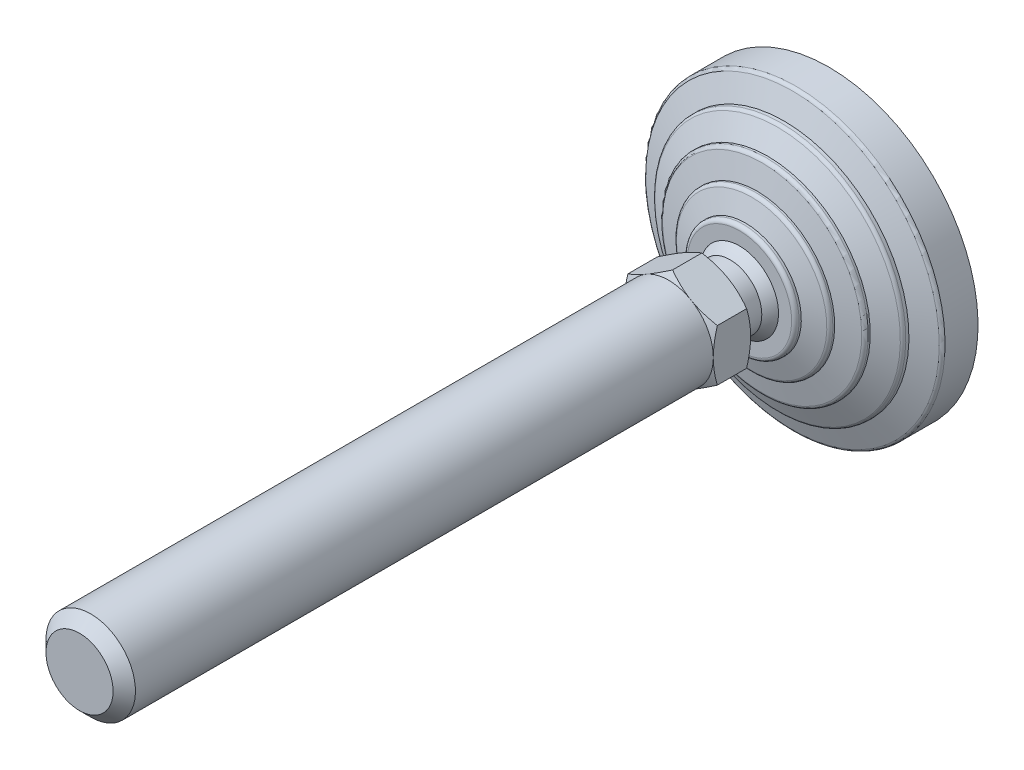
ISO-10303-21;
HEADER;
FILE_DESCRIPTION(('STEP AP214'),'2;1');
FILE_NAME('part.step','',(''),(''),'','','');
FILE_SCHEMA(('AUTOMOTIVE_DESIGN { 1 0 10303 214 1 1 1 1 }'));
ENDSEC;
DATA;
#1=APPLICATION_CONTEXT('core data for automotive mechanical design processes');
#2=APPLICATION_PROTOCOL_DEFINITION('international standard','automotive_design',2000,#1);
#3=PRODUCT_CONTEXT('',#1,'mechanical');
#4=PRODUCT('Part','Part','',(#3));
#5=PRODUCT_RELATED_PRODUCT_CATEGORY('part','',(#4));
#6=PRODUCT_DEFINITION_FORMATION('','',#4);
#7=PRODUCT_DEFINITION_CONTEXT('part definition',#1,'design');
#8=PRODUCT_DEFINITION('design','',#6,#7);
#9=PRODUCT_DEFINITION_SHAPE('','',#8);
#10=(LENGTH_UNIT() NAMED_UNIT(*) SI_UNIT(.MILLI.,.METRE.));
#11=(NAMED_UNIT(*) PLANE_ANGLE_UNIT() SI_UNIT($,.RADIAN.));
#12=(NAMED_UNIT(*) SI_UNIT($,.STERADIAN.) SOLID_ANGLE_UNIT());
#13=UNCERTAINTY_MEASURE_WITH_UNIT(LENGTH_MEASURE(1.E-05),#10,'distance_accuracy_value','');
#14=(GEOMETRIC_REPRESENTATION_CONTEXT(3) GLOBAL_UNCERTAINTY_ASSIGNED_CONTEXT((#13)) GLOBAL_UNIT_ASSIGNED_CONTEXT((#10,
#11,#12)) REPRESENTATION_CONTEXT('',''));
#15=CARTESIAN_POINT('',(0.,0.,0.));
#16=DIRECTION('',(0.,0.,1.));
#17=DIRECTION('',(1.,0.,0.));
#18=AXIS2_PLACEMENT_3D('',#15,#16,#17);
#19=CARTESIAN_POINT('',(0.,0.,0.));
#20=DIRECTION('',(0.,0.,1.));
#21=DIRECTION('',(0.,-1.,0.));
#22=AXIS2_PLACEMENT_3D('',#19,#20,#21);
#23=PLANE('',#22);
#24=CARTESIAN_POINT('',(0.,0.,0.));
#25=DIRECTION('',(0.,0.,-1.));
#26=DIRECTION('',(0.,1.,0.));
#27=AXIS2_PLACEMENT_3D('',#24,#25,#26);
#28=CIRCLE('',#27,33.5);
#29=CARTESIAN_POINT('',(0.,33.5,0.));
#30=VERTEX_POINT('',#29);
#31=EDGE_CURVE('E342',#30,#30,#28,.T.);
#32=ORIENTED_EDGE('',*,*,#31,.T.);
#33=EDGE_LOOP('',(#32));
#34=FACE_BOUND('',#33,.T.);
#35=ADVANCED_FACE('F14',(#34),#23,.F.);
#36=CARTESIAN_POINT('',(-8.50000000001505,0.,35.9999999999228));
#37=DIRECTION('',(0.,0.,1.));
#38=DIRECTION('',(0.,-1.,0.));
#39=AXIS2_PLACEMENT_3D('',#36,#37,#38);
#40=PLANE('',#39);
#41=CARTESIAN_POINT('',(0.,0.,35.9999999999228));
#42=DIRECTION('',(0.,0.,-1.));
#43=DIRECTION('',(0.,1.,0.));
#44=AXIS2_PLACEMENT_3D('',#41,#42,#43);
#45=CIRCLE('',#44,8.50000000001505);
#46=CARTESIAN_POINT('',(0.,8.50000000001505,35.9999999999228));
#47=VERTEX_POINT('',#46);
#48=EDGE_CURVE('E408',#47,#47,#45,.T.);
#49=ORIENTED_EDGE('',*,*,#48,.F.);
#50=EDGE_LOOP('',(#49));
#51=FACE_BOUND('',#50,.T.);
#52=CARTESIAN_POINT('',(0.,0.,35.9999999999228));
#53=DIRECTION('',(0.,0.,-1.));
#54=DIRECTION('',(-1.,0.,0.));
#55=AXIS2_PLACEMENT_3D('',#52,#53,#54);
#56=CIRCLE('',#55,12.);
#57=CARTESIAN_POINT('',(6.,10.3923048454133,35.9999999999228));
#58=VERTEX_POINT('',#57);
#59=CARTESIAN_POINT('',(12.,0.,35.9999999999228));
#60=VERTEX_POINT('',#59);
#61=EDGE_CURVE('E422',#58,#60,#56,.T.);
#62=ORIENTED_EDGE('',*,*,#61,.T.);
#63=CARTESIAN_POINT('',(6.,-10.3923048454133,35.9999999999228));
#64=VERTEX_POINT('',#63);
#65=EDGE_CURVE('E140',#60,#64,#56,.T.);
#66=ORIENTED_EDGE('',*,*,#65,.T.);
#67=CARTESIAN_POINT('',(-6.,-10.3923048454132,35.9999999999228));
#68=VERTEX_POINT('',#67);
#69=EDGE_CURVE('E139',#64,#68,#56,.T.);
#70=ORIENTED_EDGE('',*,*,#69,.T.);
#71=CARTESIAN_POINT('',(-12.,0.,35.9999999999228));
#72=VERTEX_POINT('',#71);
#73=EDGE_CURVE('E116',#68,#72,#56,.T.);
#74=ORIENTED_EDGE('',*,*,#73,.T.);
#75=CARTESIAN_POINT('',(-6.,10.3923048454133,35.9999999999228));
#76=VERTEX_POINT('',#75);
#77=EDGE_CURVE('E104',#72,#76,#56,.T.);
#78=ORIENTED_EDGE('',*,*,#77,.T.);
#79=EDGE_CURVE('E33',#76,#58,#56,.T.);
#80=ORIENTED_EDGE('',*,*,#79,.T.);
#81=EDGE_LOOP('',(#62,#66,#70,#74,#78,#80));
#82=FACE_BOUND('',#81,.T.);
#83=ADVANCED_FACE('F137',(#51,#82),#40,.F.);
#84=CARTESIAN_POINT('',(0.,0.,0.));
#85=DIRECTION('',(0.,0.,-1.));
#86=DIRECTION('',(0.,1.,0.));
#87=AXIS2_PLACEMENT_3D('',#84,#85,#86);
#88=CYLINDRICAL_SURFACE('',#87,8.50000000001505);
#89=CARTESIAN_POINT('',(0.,0.,29.4999999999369));
#90=DIRECTION('',(0.,0.,-1.));
#91=DIRECTION('',(0.,1.,0.));
#92=AXIS2_PLACEMENT_3D('',#89,#90,#91);
#93=CIRCLE('',#92,8.50000000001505);
#94=CARTESIAN_POINT('',(0.,8.50000000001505,29.4999999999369));
#95=VERTEX_POINT('',#94);
#96=EDGE_CURVE('E405',#95,#95,#93,.T.);
#97=ORIENTED_EDGE('',*,*,#96,.F.);
#98=EDGE_LOOP('',(#97));
#99=FACE_BOUND('',#98,.T.);
#100=ORIENTED_EDGE('',*,*,#48,.T.);
#101=EDGE_LOOP('',(#100));
#102=FACE_BOUND('',#101,.T.);
#103=ADVANCED_FACE('F309',(#99,#102),#88,.T.);
#104=CARTESIAN_POINT('',(-8.49107182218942,0.,29.4999999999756));
#105=DIRECTION('',(0.,0.,1.));
#106=DIRECTION('',(0.,-1.,0.));
#107=AXIS2_PLACEMENT_3D('',#104,#105,#106);
#108=PLANE('',#107);
#109=CARTESIAN_POINT('',(0.,0.,29.4999999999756));
#110=DIRECTION('',(0.,0.,-1.));
#111=DIRECTION('',(0.,1.,0.));
#112=AXIS2_PLACEMENT_3D('',#109,#110,#111);
#113=CIRCLE('',#112,8.49107182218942);
#114=CARTESIAN_POINT('',(-8.4910718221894,0.,29.4999999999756));
#115=VERTEX_POINT('',#114);
#116=EDGE_CURVE('E402',#115,#115,#113,.T.);
#117=ORIENTED_EDGE('',*,*,#116,.F.);
#118=EDGE_LOOP('',(#117));
#119=FACE_BOUND('',#118,.T.);
#120=ORIENTED_EDGE('',*,*,#96,.T.);
#121=EDGE_LOOP('',(#120));
#122=FACE_BOUND('',#121,.T.);
#123=ADVANCED_FACE('F305',(#119,#122),#108,.F.);
#124=CARTESIAN_POINT('',(-2.8865798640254E-12,0.,20.6702661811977));
#125=DIRECTION('',(0.,0.,-1.));
#126=DIRECTION('',(-1.,0.,0.));
#127=AXIS2_PLACEMENT_3D('',#124,#125,#126);
#128=SPHERICAL_SURFACE('',#127,12.25);
#129=CARTESIAN_POINT('',(0.,0.,27.));
#130=DIRECTION('',(0.,0.,-1.));
#131=DIRECTION('',(0.,1.,0.));
#132=AXIS2_PLACEMENT_3D('',#129,#130,#131);
#133=CIRCLE('',#132,10.4879440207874);
#134=CARTESIAN_POINT('',(-10.4879440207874,0.,27.));
#135=VERTEX_POINT('',#134);
#136=EDGE_CURVE('E399',#135,#135,#133,.T.);
#137=CARTESIAN_POINT('',(-10.4879440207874,0.,27.));
#138=CARTESIAN_POINT('',(-10.4706730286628,0.,27.0286168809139));
#139=CARTESIAN_POINT('',(-10.4532849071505,0.,27.0571630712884));
#140=CARTESIAN_POINT('',(-10.4182755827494,0.,27.1141121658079));
#141=CARTESIAN_POINT('',(-10.4006543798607,0.,27.1425150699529));
#142=CARTESIAN_POINT('',(-10.3651800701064,0.,27.1991756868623));
#143=CARTESIAN_POINT('',(-10.3473269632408,0.,27.2274333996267));
#144=CARTESIAN_POINT('',(-10.3113900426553,0.,27.283801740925));
#145=CARTESIAN_POINT('',(-10.2933062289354,0.,27.3119123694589));
#146=CARTESIAN_POINT('',(-10.256909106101,0.,27.367984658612));
#147=CARTESIAN_POINT('',(-10.2385957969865,0.,27.3959463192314));
#148=CARTESIAN_POINT('',(-10.2017409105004,0.,27.4517187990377));
#149=CARTESIAN_POINT('',(-10.1831993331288,0.,27.4795296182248));
#150=CARTESIAN_POINT('',(-10.1458891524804,0.,27.5349985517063));
#151=CARTESIAN_POINT('',(-10.1271205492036,0.,27.5626566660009));
#152=CARTESIAN_POINT('',(-10.08935757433,0.,27.6178183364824));
#153=CARTESIAN_POINT('',(-10.0703632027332,0.,27.6453218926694));
#154=CARTESIAN_POINT('',(-10.0321499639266,0.,27.7001726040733));
#155=CARTESIAN_POINT('',(-10.0129310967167,0.,27.7275197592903));
#156=CARTESIAN_POINT('',(-9.97427015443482,0.,27.7820558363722));
#157=CARTESIAN_POINT('',(-9.9548280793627,0.,27.8092447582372));
#158=CARTESIAN_POINT('',(-9.91572202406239,0.,27.8634625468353));
#159=CARTESIAN_POINT('',(-9.89605804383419,0.,27.8904914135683));
#160=CARTESIAN_POINT('',(-9.85650949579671,0.,27.9443872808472));
#161=CARTESIAN_POINT('',(-9.83662492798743,0.,27.971254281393));
#162=CARTESIAN_POINT('',(-9.79663653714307,0.,28.0248246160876));
#163=CARTESIAN_POINT('',(-9.776532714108,0.,28.0515279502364));
#164=CARTESIAN_POINT('',(-9.73610715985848,0.,28.1047691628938));
#165=CARTESIAN_POINT('',(-9.71578542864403,0.,28.1313070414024));
#166=CARTESIAN_POINT('',(-9.67492541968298,0.,28.1842155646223));
#167=CARTESIAN_POINT('',(-9.65438714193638,0.,28.2105862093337));
#168=CARTESIAN_POINT('',(-9.61309541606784,0.,28.2631584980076));
#169=CARTESIAN_POINT('',(-9.59234196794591,0.,28.2893601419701));
#170=CARTESIAN_POINT('',(-9.5506212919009,0.,28.3415926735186));
#171=CARTESIAN_POINT('',(-9.52965406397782,0.,28.3676235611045));
#172=CARTESIAN_POINT('',(-9.48750723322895,0.,28.4195128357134));
#173=CARTESIAN_POINT('',(-9.46632763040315,0.,28.4453712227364));
#174=CARTESIAN_POINT('',(-9.42375746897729,0.,28.4969137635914));
#175=CARTESIAN_POINT('',(-9.40236691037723,0.,28.5225979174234));
#176=CARTESIAN_POINT('',(-9.35937627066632,0.,28.5737902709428));
#177=CARTESIAN_POINT('',(-9.33777618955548,0.,28.5992984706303));
#178=CARTESIAN_POINT('',(-9.29436795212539,0.,28.6501372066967));
#179=CARTESIAN_POINT('',(-9.27255979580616,0.,28.6754677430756));
#180=CARTESIAN_POINT('',(-9.2287368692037,0.,28.7259494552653));
#181=CARTESIAN_POINT('',(-9.20672209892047,0.,28.7511006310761));
#182=CARTESIAN_POINT('',(-9.16248741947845,0.,28.8012219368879));
#183=CARTESIAN_POINT('',(-9.14026751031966,0.,28.8261920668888));
#184=CARTESIAN_POINT('',(-9.09562404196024,0.,28.8759496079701));
#185=CARTESIAN_POINT('',(-9.07320048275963,0.,28.9007370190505));
#186=CARTESIAN_POINT('',(-9.02815121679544,0.,28.9501274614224));
#187=CARTESIAN_POINT('',(-9.00552551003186,0.,28.9747304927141));
#188=CARTESIAN_POINT('',(-8.9600734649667,0.,29.0237505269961));
#189=CARTESIAN_POINT('',(-8.93724712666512,0.,29.0481675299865));
#190=CARTESIAN_POINT('',(-8.89139534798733,0.,29.0968138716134));
#191=CARTESIAN_POINT('',(-8.86836990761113,0.,29.1210432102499));
#192=CARTESIAN_POINT('',(-8.82212146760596,0.,29.1693125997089));
#193=CARTESIAN_POINT('',(-8.79889846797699,0.,29.1933526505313));
#194=CARTESIAN_POINT('',(-8.75225646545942,0.,29.2412418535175));
#195=CARTESIAN_POINT('',(-8.72883746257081,0.,29.2650910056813));
#196=CARTESIAN_POINT('',(-8.68180502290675,0.,29.3125968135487));
#197=CARTESIAN_POINT('',(-8.65819158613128,0.,29.3362534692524));
#198=CARTESIAN_POINT('',(-8.61077186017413,0.,29.3833726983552));
#199=CARTESIAN_POINT('',(-8.58696557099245,0.,29.4068352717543));
#200=CARTESIAN_POINT('',(-8.53916173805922,0.,29.4535647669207));
#201=CARTESIAN_POINT('',(-8.51516419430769,0.,29.476831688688));
#202=CARTESIAN_POINT('',(-8.4910718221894,0.,29.4999999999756));
#203=B_SPLINE_CURVE_WITH_KNOTS('',3,(#137,#138,#139,#140,#141,#142,#143,#144,#145,#146,#147,
#148,#149,#150,#151,#152,#153,#154,#155,#156,#157,#158,#159,#160,#161,#162,#163,#164,#165,#166,
#167,#168,#169,#170,#171,#172,#173,#174,#175,#176,#177,#178,#179,#180,#181,#182,#183,#184,#185,
#186,#187,#188,#189,#190,#191,#192,#193,#194,#195,#196,#197,#198,#199,#200,#201,#202),
.UNSPECIFIED.,.F.,.F.,(4,2,2,2,2,2,2,2,2,2,2,2,2,2,2,2,2,2,2,2,2,2,2,2,2,2,2,2,2,2,2,2,4),(0.,
0.100273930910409,0.200547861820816,0.300821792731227,0.401095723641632,0.501369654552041,
0.601643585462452,0.701917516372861,0.802191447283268,0.902465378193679,1.00273930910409,
1.1030132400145,1.2032871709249,1.30356110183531,1.40383503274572,1.50410896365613,
1.60438289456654,1.70465682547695,1.80493075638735,1.90520468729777,2.00547861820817,
2.10575254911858,2.20602648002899,2.3063004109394,2.40657434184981,2.50684827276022,
2.60712220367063,2.70739613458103,2.80767006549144,2.90794399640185,3.00821792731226,
3.10849185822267,3.20876578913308),.UNSPECIFIED.);
#204=EDGE_CURVE('BSEAM301',#135,#115,#203,.T.);
#205=ORIENTED_EDGE('',*,*,#136,.F.);
#206=ORIENTED_EDGE('',*,*,#116,.T.);
#207=ORIENTED_EDGE('',*,*,#204,.T.);
#208=ORIENTED_EDGE('',*,*,#204,.F.);
#209=EDGE_LOOP('',(#205,#207,#206,#208));
#210=FACE_BOUND('',#209,.T.);
#211=ADVANCED_FACE('F301',(#210),#128,.T.);
#212=CARTESIAN_POINT('',(-10.4879440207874,0.,27.));
#213=DIRECTION('',(0.,0.,-1.));
#214=DIRECTION('',(0.,1.,0.));
#215=AXIS2_PLACEMENT_3D('',#212,#213,#214);
#216=PLANE('',#215);
#217=CARTESIAN_POINT('',(0.,0.,27.));
#218=DIRECTION('',(0.,0.,-1.));
#219=DIRECTION('',(0.,1.,0.));
#220=AXIS2_PLACEMENT_3D('',#217,#218,#219);
#221=CIRCLE('',#220,14.);
#222=CARTESIAN_POINT('',(0.,14.,27.));
#223=VERTEX_POINT('',#222);
#224=EDGE_CURVE('E396',#223,#223,#221,.T.);
#225=ORIENTED_EDGE('',*,*,#224,.F.);
#226=EDGE_LOOP('',(#225));
#227=FACE_BOUND('',#226,.T.);
#228=ORIENTED_EDGE('',*,*,#136,.T.);
#229=EDGE_LOOP('',(#228));
#230=FACE_BOUND('',#229,.T.);
#231=ADVANCED_FACE('F297',(#227,#230),#216,.F.);
#232=CARTESIAN_POINT('',(0.,0.,26.));
#233=DIRECTION('',(0.,0.,-1.));
#234=DIRECTION('',(0.,1.,0.));
#235=AXIS2_PLACEMENT_3D('',#232,#233,#234);
#236=TOROIDAL_SURFACE('',#235,14.,1.);
#237=CARTESIAN_POINT('',(0.,0.,26.));
#238=DIRECTION('',(0.,0.,-1.));
#239=DIRECTION('',(0.,1.,0.));
#240=AXIS2_PLACEMENT_3D('',#237,#238,#239);
#241=CIRCLE('',#240,15.);
#242=CARTESIAN_POINT('',(0.,15.,26.));
#243=VERTEX_POINT('',#242);
#244=EDGE_CURVE('E393',#243,#243,#241,.T.);
#245=ORIENTED_EDGE('',*,*,#244,.F.);
#246=EDGE_LOOP('',(#245));
#247=FACE_BOUND('',#246,.T.);
#248=ORIENTED_EDGE('',*,*,#224,.T.);
#249=EDGE_LOOP('',(#248));
#250=FACE_BOUND('',#249,.T.);
#251=ADVANCED_FACE('F293',(#247,#250),#236,.T.);
#252=CARTESIAN_POINT('',(0.,0.,0.));
#253=DIRECTION('',(0.,0.,-1.));
#254=DIRECTION('',(0.,1.,0.));
#255=AXIS2_PLACEMENT_3D('',#252,#253,#254);
#256=CYLINDRICAL_SURFACE('',#255,15.);
#257=CARTESIAN_POINT('',(0.,0.,25.4025287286));
#258=DIRECTION('',(0.,0.,-1.));
#259=DIRECTION('',(0.,1.,0.));
#260=AXIS2_PLACEMENT_3D('',#257,#258,#259);
#261=CIRCLE('',#260,15.);
#262=CARTESIAN_POINT('',(0.,15.,25.4025287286));
#263=VERTEX_POINT('',#262);
#264=EDGE_CURVE('E390',#263,#263,#261,.T.);
#265=ORIENTED_EDGE('',*,*,#264,.F.);
#266=EDGE_LOOP('',(#265));
#267=FACE_BOUND('',#266,.T.);
#268=ORIENTED_EDGE('',*,*,#244,.T.);
#269=EDGE_LOOP('',(#268));
#270=FACE_BOUND('',#269,.T.);
#271=ADVANCED_FACE('F289',(#267,#270),#256,.T.);
#272=CARTESIAN_POINT('',(0.,0.,25.4025287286));
#273=DIRECTION('',(0.,0.,-1.));
#274=DIRECTION('',(0.,1.,0.));
#275=AXIS2_PLACEMENT_3D('',#272,#273,#274);
#276=CONICAL_SURFACE('',#275,15.,1.25589726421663);
#277=CARTESIAN_POINT('',(0.,0.,23.7216684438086));
#278=DIRECTION('',(0.,0.,-1.));
#279=DIRECTION('',(0.,1.,0.));
#280=AXIS2_PLACEMENT_3D('',#277,#278,#279);
#281=CIRCLE('',#280,20.16016354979);
#282=CARTESIAN_POINT('',(0.,20.16016354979,23.7216684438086));
#283=VERTEX_POINT('',#282);
#284=EDGE_CURVE('E387',#283,#283,#281,.T.);
#285=ORIENTED_EDGE('',*,*,#284,.F.);
#286=EDGE_LOOP('',(#285));
#287=FACE_BOUND('',#286,.T.);
#288=ORIENTED_EDGE('',*,*,#264,.T.);
#289=EDGE_LOOP('',(#288));
#290=FACE_BOUND('',#289,.T.);
#291=ADVANCED_FACE('F285',(#287,#290),#276,.T.);
#292=CARTESIAN_POINT('',(0.,0.,22.7708407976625));
#293=DIRECTION('',(0.,0.,-1.));
#294=DIRECTION('',(0.,1.,0.));
#295=AXIS2_PLACEMENT_3D('',#292,#293,#294);
#296=TOROIDAL_SURFACE('',#295,19.8504430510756,0.999999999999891);
#297=CARTESIAN_POINT('',(0.,0.,22.7708407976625));
#298=DIRECTION('',(0.,0.,-1.));
#299=DIRECTION('',(0.,1.,0.));
#300=AXIS2_PLACEMENT_3D('',#297,#298,#299);
#301=CIRCLE('',#300,20.8504430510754);
#302=CARTESIAN_POINT('',(0.,20.8504430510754,22.7708407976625));
#303=VERTEX_POINT('',#302);
#304=EDGE_CURVE('E384',#303,#303,#301,.T.);
#305=ORIENTED_EDGE('',*,*,#304,.F.);
#306=EDGE_LOOP('',(#305));
#307=FACE_BOUND('',#306,.T.);
#308=ORIENTED_EDGE('',*,*,#284,.T.);
#309=EDGE_LOOP('',(#308));
#310=FACE_BOUND('',#309,.T.);
#311=ADVANCED_FACE('F281',(#307,#310),#296,.T.);
#312=CARTESIAN_POINT('',(0.,0.,0.));
#313=DIRECTION('',(0.,0.,-1.));
#314=DIRECTION('',(0.,1.,0.));
#315=AXIS2_PLACEMENT_3D('',#312,#313,#314);
#316=CYLINDRICAL_SURFACE('',#315,20.8504430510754);
#317=CARTESIAN_POINT('',(0.,0.,22.2987385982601));
#318=DIRECTION('',(0.,0.,-1.));
#319=DIRECTION('',(0.,1.,0.));
#320=AXIS2_PLACEMENT_3D('',#317,#318,#319);
#321=CIRCLE('',#320,20.8504430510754);
#322=CARTESIAN_POINT('',(0.,20.8504430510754,22.2987385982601));
#323=VERTEX_POINT('',#322);
#324=EDGE_CURVE('E381',#323,#323,#321,.T.);
#325=ORIENTED_EDGE('',*,*,#324,.F.);
#326=EDGE_LOOP('',(#325));
#327=FACE_BOUND('',#326,.T.);
#328=ORIENTED_EDGE('',*,*,#304,.T.);
#329=EDGE_LOOP('',(#328));
#330=FACE_BOUND('',#329,.T.);
#331=ADVANCED_FACE('F277',(#327,#330),#316,.T.);
#332=CARTESIAN_POINT('',(0.,0.,22.2987385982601));
#333=DIRECTION('',(0.,0.,-1.));
#334=DIRECTION('',(0.,1.,0.));
#335=AXIS2_PLACEMENT_3D('',#332,#333,#334);
#336=CONICAL_SURFACE('',#335,20.8504430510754,1.34067144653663);
#337=CARTESIAN_POINT('',(0.,0.,20.9217501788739));
#338=DIRECTION('',(0.,0.,-1.));
#339=DIRECTION('',(0.,1.,0.));
#340=AXIS2_PLACEMENT_3D('',#337,#338,#339);
#341=CIRCLE('',#340,26.7280991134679);
#342=CARTESIAN_POINT('',(0.,26.7280991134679,20.9217501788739));
#343=VERTEX_POINT('',#342);
#344=EDGE_CURVE('E378',#343,#343,#341,.T.);
#345=ORIENTED_EDGE('',*,*,#344,.F.);
#346=EDGE_LOOP('',(#345));
#347=FACE_BOUND('',#346,.T.);
#348=ORIENTED_EDGE('',*,*,#324,.T.);
#349=EDGE_LOOP('',(#348));
#350=FACE_BOUND('',#349,.T.);
#351=ADVANCED_FACE('F273',(#347,#350),#336,.T.);
#352=CARTESIAN_POINT('',(0.,0.,19.9481122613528));
#353=DIRECTION('',(0.,0.,-1.));
#354=DIRECTION('',(0.,1.,0.));
#355=AXIS2_PLACEMENT_3D('',#352,#353,#354);
#356=TOROIDAL_SURFACE('',#355,26.5,0.999999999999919);
#357=CARTESIAN_POINT('',(0.,0.,19.9481122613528));
#358=DIRECTION('',(0.,0.,-1.));
#359=DIRECTION('',(0.,1.,0.));
#360=AXIS2_PLACEMENT_3D('',#357,#358,#359);
#361=CIRCLE('',#360,27.5);
#362=CARTESIAN_POINT('',(0.,27.5,19.9481122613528));
#363=VERTEX_POINT('',#362);
#364=EDGE_CURVE('E375',#363,#363,#361,.T.);
#365=ORIENTED_EDGE('',*,*,#364,.F.);
#366=EDGE_LOOP('',(#365));
#367=FACE_BOUND('',#366,.T.);
#368=ORIENTED_EDGE('',*,*,#344,.T.);
#369=EDGE_LOOP('',(#368));
#370=FACE_BOUND('',#369,.T.);
#371=ADVANCED_FACE('F269',(#367,#370),#356,.T.);
#372=CARTESIAN_POINT('',(0.,0.,0.));
#373=DIRECTION('',(0.,0.,-1.));
#374=DIRECTION('',(0.,1.,0.));
#375=AXIS2_PLACEMENT_3D('',#372,#373,#374);
#376=CYLINDRICAL_SURFACE('',#375,27.5);
#377=CARTESIAN_POINT('',(0.,0.,19.4025287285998));
#378=DIRECTION('',(0.,0.,-1.));
#379=DIRECTION('',(0.,1.,0.));
#380=AXIS2_PLACEMENT_3D('',#377,#378,#379);
#381=CIRCLE('',#380,27.5);
#382=CARTESIAN_POINT('',(0.,27.5,19.4025287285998));
#383=VERTEX_POINT('',#382);
#384=EDGE_CURVE('E372',#383,#383,#381,.T.);
#385=ORIENTED_EDGE('',*,*,#384,.F.);
#386=EDGE_LOOP('',(#385));
#387=FACE_BOUND('',#386,.T.);
#388=ORIENTED_EDGE('',*,*,#364,.T.);
#389=EDGE_LOOP('',(#388));
#390=FACE_BOUND('',#389,.T.);
#391=ADVANCED_FACE('F265',(#387,#390),#376,.T.);
#392=CARTESIAN_POINT('',(0.,0.,19.4025287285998));
#393=DIRECTION('',(0.,0.,-1.));
#394=DIRECTION('',(0.,1.,0.));
#395=AXIS2_PLACEMENT_3D('',#392,#393,#394);
#396=CONICAL_SURFACE('',#395,27.5,1.1202291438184);
#397=CARTESIAN_POINT('',(0.,0.,16.773091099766));
#398=DIRECTION('',(0.,0.,-1.));
#399=DIRECTION('',(0.,1.,0.));
#400=AXIS2_PLACEMENT_3D('',#397,#398,#399);
#401=CIRCLE('',#400,32.9354761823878);
#402=CARTESIAN_POINT('',(0.,32.9354761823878,16.773091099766));
#403=VERTEX_POINT('',#402);
#404=EDGE_CURVE('E369',#403,#403,#401,.T.);
#405=ORIENTED_EDGE('',*,*,#404,.F.);
#406=EDGE_LOOP('',(#405));
#407=FACE_BOUND('',#406,.T.);
#408=ORIENTED_EDGE('',*,*,#384,.T.);
#409=EDGE_LOOP('',(#408));
#410=FACE_BOUND('',#409,.T.);
#411=ADVANCED_FACE('F261',(#407,#410),#396,.T.);
#412=CARTESIAN_POINT('',(0.,0.,15.8728908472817));
#413=DIRECTION('',(0.,0.,-1.));
#414=DIRECTION('',(0.,1.,0.));
#415=AXIS2_PLACEMENT_3D('',#412,#413,#414);
#416=TOROIDAL_SURFACE('',#415,32.5,1.00000000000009);
#417=CARTESIAN_POINT('',(0.,0.,15.8728908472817));
#418=DIRECTION('',(0.,0.,-1.));
#419=DIRECTION('',(0.,1.,0.));
#420=AXIS2_PLACEMENT_3D('',#417,#418,#419);
#421=CIRCLE('',#420,33.5);
#422=CARTESIAN_POINT('',(0.,33.5,15.8728908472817));
#423=VERTEX_POINT('',#422);
#424=EDGE_CURVE('E366',#423,#423,#421,.T.);
#425=ORIENTED_EDGE('',*,*,#424,.F.);
#426=EDGE_LOOP('',(#425));
#427=FACE_BOUND('',#426,.T.);
#428=ORIENTED_EDGE('',*,*,#404,.T.);
#429=EDGE_LOOP('',(#428));
#430=FACE_BOUND('',#429,.T.);
#431=ADVANCED_FACE('F257',(#427,#430),#416,.T.);
#432=CARTESIAN_POINT('',(0.,0.,0.));
#433=DIRECTION('',(0.,0.,-1.));
#434=DIRECTION('',(0.,1.,0.));
#435=AXIS2_PLACEMENT_3D('',#432,#433,#434);
#436=CYLINDRICAL_SURFACE('',#435,33.5);
#437=CARTESIAN_POINT('',(0.,0.,15.0315037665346));
#438=DIRECTION('',(0.,0.,-1.));
#439=DIRECTION('',(0.,1.,0.));
#440=AXIS2_PLACEMENT_3D('',#437,#438,#439);
#441=CIRCLE('',#440,33.5);
#442=CARTESIAN_POINT('',(0.,33.5,15.0315037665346));
#443=VERTEX_POINT('',#442);
#444=EDGE_CURVE('E363',#443,#443,#441,.T.);
#445=ORIENTED_EDGE('',*,*,#444,.F.);
#446=EDGE_LOOP('',(#445));
#447=FACE_BOUND('',#446,.T.);
#448=ORIENTED_EDGE('',*,*,#424,.T.);
#449=EDGE_LOOP('',(#448));
#450=FACE_BOUND('',#449,.T.);
#451=ADVANCED_FACE('F253',(#447,#450),#436,.T.);
#452=CARTESIAN_POINT('',(0.,0.,15.0315037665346));
#453=DIRECTION('',(0.,0.,-1.));
#454=DIRECTION('',(0.,1.,0.));
#455=AXIS2_PLACEMENT_3D('',#452,#453,#454);
#456=CONICAL_SURFACE('',#455,33.5,1.20362249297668);
#457=CARTESIAN_POINT('',(0.,0.,12.7780502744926));
#458=DIRECTION('',(0.,0.,-1.));
#459=DIRECTION('',(0.,1.,0.));
#460=AXIS2_PLACEMENT_3D('',#457,#458,#459);
#461=CIRCLE('',#460,39.3589790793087);
#462=CARTESIAN_POINT('',(0.,39.3589790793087,12.7780502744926));
#463=VERTEX_POINT('',#462);
#464=EDGE_CURVE('E360',#463,#463,#461,.T.);
#465=ORIENTED_EDGE('',*,*,#464,.F.);
#466=EDGE_LOOP('',(#465));
#467=FACE_BOUND('',#466,.T.);
#468=ORIENTED_EDGE('',*,*,#444,.T.);
#469=EDGE_LOOP('',(#468));
#470=FACE_BOUND('',#469,.T.);
#471=ADVANCED_FACE('F249',(#467,#470),#456,.T.);
#472=CARTESIAN_POINT('',(0.,0.,11.8447046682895));
#473=DIRECTION('',(0.,0.,-1.));
#474=DIRECTION('',(0.,1.,0.));
#475=AXIS2_PLACEMENT_3D('',#472,#473,#474);
#476=TOROIDAL_SURFACE('',#475,39.,1.00000000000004);
#477=CARTESIAN_POINT('',(0.,0.,11.8447046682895));
#478=DIRECTION('',(0.,0.,-1.));
#479=DIRECTION('',(0.,1.,0.));
#480=AXIS2_PLACEMENT_3D('',#477,#478,#479);
#481=CIRCLE('',#480,40.);
#482=CARTESIAN_POINT('',(0.,40.,11.8447046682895));
#483=VERTEX_POINT('',#482);
#484=EDGE_CURVE('E357',#483,#483,#481,.T.);
#485=ORIENTED_EDGE('',*,*,#484,.F.);
#486=EDGE_LOOP('',(#485));
#487=FACE_BOUND('',#486,.T.);
#488=ORIENTED_EDGE('',*,*,#464,.T.);
#489=EDGE_LOOP('',(#488));
#490=FACE_BOUND('',#489,.T.);
#491=ADVANCED_FACE('F245',(#487,#490),#476,.T.);
#492=CARTESIAN_POINT('',(0.,0.,0.));
#493=DIRECTION('',(0.,0.,-1.));
#494=DIRECTION('',(0.,1.,0.));
#495=AXIS2_PLACEMENT_3D('',#492,#493,#494);
#496=CYLINDRICAL_SURFACE('',#495,40.);
#497=CARTESIAN_POINT('',(0.,0.,3.));
#498=DIRECTION('',(0.,0.,-1.));
#499=DIRECTION('',(0.,1.,0.));
#500=AXIS2_PLACEMENT_3D('',#497,#498,#499);
#501=CIRCLE('',#500,40.);
#502=CARTESIAN_POINT('',(0.,40.,3.));
#503=VERTEX_POINT('',#502);
#504=EDGE_CURVE('E347',#503,#503,#501,.T.);
#505=ORIENTED_EDGE('',*,*,#504,.F.);
#506=EDGE_LOOP('',(#505));
#507=FACE_BOUND('',#506,.T.);
#508=ORIENTED_EDGE('',*,*,#484,.T.);
#509=EDGE_LOOP('',(#508));
#510=FACE_BOUND('',#509,.T.);
#511=ADVANCED_FACE('F241',(#507,#510),#496,.T.);
#512=CARTESIAN_POINT('',(-33.5,0.,3.));
#513=DIRECTION('',(0.,0.,1.));
#514=DIRECTION('',(0.,-1.,0.));
#515=AXIS2_PLACEMENT_3D('',#512,#513,#514);
#516=PLANE('',#515);
#517=CARTESIAN_POINT('',(0.,0.,3.));
#518=DIRECTION('',(0.,0.,-1.));
#519=DIRECTION('',(0.,1.,0.));
#520=AXIS2_PLACEMENT_3D('',#517,#518,#519);
#521=CIRCLE('',#520,33.5);
#522=CARTESIAN_POINT('',(0.,33.5,3.));
#523=VERTEX_POINT('',#522);
#524=EDGE_CURVE('E343',#523,#523,#521,.T.);
#525=ORIENTED_EDGE('',*,*,#524,.F.);
#526=EDGE_LOOP('',(#525));
#527=FACE_BOUND('',#526,.T.);
#528=ORIENTED_EDGE('',*,*,#504,.T.);
#529=EDGE_LOOP('',(#528));
#530=FACE_BOUND('',#529,.T.);
#531=ADVANCED_FACE('F237',(#527,#530),#516,.F.);
#532=CARTESIAN_POINT('',(0.,0.,0.));
#533=DIRECTION('',(0.,0.,-1.));
#534=DIRECTION('',(0.,1.,0.));
#535=AXIS2_PLACEMENT_3D('',#532,#533,#534);
#536=CYLINDRICAL_SURFACE('',#535,33.5);
#537=ORIENTED_EDGE('',*,*,#31,.F.);
#538=EDGE_LOOP('',(#537));
#539=FACE_BOUND('',#538,.T.);
#540=ORIENTED_EDGE('',*,*,#524,.T.);
#541=EDGE_LOOP('',(#540));
#542=FACE_BOUND('',#541,.T.);
#543=ADVANCED_FACE('F233',(#539,#542),#536,.T.);
#544=CARTESIAN_POINT('',(0.,0.,38.8081422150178));
#545=DIRECTION('',(0.,0.,1.));
#546=DIRECTION('',(1.,0.,0.));
#547=AXIS2_PLACEMENT_3D('',#544,#545,#546);
#548=CONICAL_SURFACE('',#547,16.8638449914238,1.0471975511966);
#549=CARTESIAN_POINT('',(12.,-18.6165456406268,41.8594962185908));
#550=CARTESIAN_POINT('',(12.,-18.3544735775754,41.7323224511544));
#551=CARTESIAN_POINT('',(12.,-18.0920941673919,41.6057823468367));
#552=CARTESIAN_POINT('',(12.,-17.5666565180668,41.3541129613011));
#553=CARTESIAN_POINT('',(12.,-17.3035982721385,41.2289836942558));
#554=CARTESIAN_POINT('',(12.,-16.5132391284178,40.8558944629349));
#555=CARTESIAN_POINT('',(12.,-15.9848312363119,40.6102707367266));
#556=CARTESIAN_POINT('',(12.,-14.9216090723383,40.1254161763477));
#557=CARTESIAN_POINT('',(12.,-14.3867755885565,39.8862273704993));
#558=CARTESIAN_POINT('',(12.,-13.312857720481,39.417625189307));
#559=CARTESIAN_POINT('',(12.,-12.7737735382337,39.1882113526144));
#560=CARTESIAN_POINT('',(12.,-11.6730479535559,38.7345540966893));
#561=CARTESIAN_POINT('',(12.,-11.1112390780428,38.5107149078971));
#562=CARTESIAN_POINT('',(12.,-9.98104689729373,38.0799608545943));
#563=CARTESIAN_POINT('',(12.,-9.4126628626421,37.8730478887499));
#564=CARTESIAN_POINT('',(12.,-8.26949648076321,37.4815765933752));
#565=CARTESIAN_POINT('',(12.,-7.69472973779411,37.2969730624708));
#566=CARTESIAN_POINT('',(12.,-6.53689683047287,36.9560296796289));
#567=CARTESIAN_POINT('',(12.,-5.95383334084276,36.7996809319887));
#568=CARTESIAN_POINT('',(12.,-5.07453194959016,36.5924322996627));
#569=CARTESIAN_POINT('',(12.,-4.78145617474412,36.528034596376));
#570=CARTESIAN_POINT('',(12.,-4.19330082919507,36.4090965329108));
#571=CARTESIAN_POINT('',(12.,-3.89822129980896,36.3545559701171));
#572=CARTESIAN_POINT('',(12.,-3.30626115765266,36.2562944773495));
#573=CARTESIAN_POINT('',(12.,-3.0093805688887,36.2125734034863));
#574=CARTESIAN_POINT('',(12.,-2.41413270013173,36.1368228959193));
#575=CARTESIAN_POINT('',(12.,-2.1157654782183,36.1047930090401));
#576=CARTESIAN_POINT('',(12.,-1.52185929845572,36.0534630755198));
#577=CARTESIAN_POINT('',(12.,-1.22633433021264,36.0340021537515));
#578=CARTESIAN_POINT('',(12.,-0.634726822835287,36.007595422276));
#579=CARTESIAN_POINT('',(12.,-0.338644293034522,36.0006494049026));
#580=CARTESIAN_POINT('',(12.,0.253549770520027,35.9994376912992));
#581=CARTESIAN_POINT('',(12.,0.549661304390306,36.0051720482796));
#582=CARTESIAN_POINT('',(12.,1.14137901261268,36.0291812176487));
#583=CARTESIAN_POINT('',(12.,1.43698516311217,36.0474566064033));
#584=CARTESIAN_POINT('',(12.,2.14723072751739,36.1060452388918));
#585=CARTESIAN_POINT('',(12.,2.56138878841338,36.1522982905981));
#586=CARTESIAN_POINT('',(12.,3.38663785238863,36.2669040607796));
#587=CARTESIAN_POINT('',(12.,3.79772843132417,36.3352597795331));
#588=CARTESIAN_POINT('',(12.,4.61644878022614,36.491639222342));
#589=CARTESIAN_POINT('',(12.,5.02407559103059,36.5796782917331));
#590=CARTESIAN_POINT('',(12.,5.8352433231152,36.7727373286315));
#591=CARTESIAN_POINT('',(12.,6.23878430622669,36.8777570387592));
#592=CARTESIAN_POINT('',(12.,7.05063476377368,37.1046979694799));
#593=CARTESIAN_POINT('',(12.,7.45885390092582,37.2269401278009));
#594=CARTESIAN_POINT('',(12.,8.27127094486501,37.4840594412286));
#595=CARTESIAN_POINT('',(12.,8.67546882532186,37.6189366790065));
#596=CARTESIAN_POINT('',(12.,9.48004279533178,37.8991842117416));
#597=CARTESIAN_POINT('',(12.,9.88042010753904,38.0445510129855));
#598=CARTESIAN_POINT('',(12.,10.6778570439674,38.3440670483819));
#599=CARTESIAN_POINT('',(12.,11.0749167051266,38.4982161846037));
#600=CARTESIAN_POINT('',(12.,12.0038930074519,38.8688129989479));
#601=CARTESIAN_POINT('',(12.,12.5346116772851,39.0882589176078));
#602=CARTESIAN_POINT('',(12.,13.5915889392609,39.5376713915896));
#603=CARTESIAN_POINT('',(12.,14.1178472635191,39.7676385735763));
#604=CARTESIAN_POINT('',(12.,15.1667229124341,40.2360102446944));
#605=CARTESIAN_POINT('',(12.,15.6893394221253,40.4744165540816));
#606=CARTESIAN_POINT('',(12.,16.7314175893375,40.9579832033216));
#607=CARTESIAN_POINT('',(12.,17.2508793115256,41.2031434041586));
#608=CARTESIAN_POINT('',(12.,18.2877200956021,41.6992334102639));
#609=CARTESIAN_POINT('',(12.,18.8050963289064,41.9501691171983));
#610=CARTESIAN_POINT('',(12.,19.8376227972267,42.4565782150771));
#611=CARTESIAN_POINT('',(12.,20.3527730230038,42.7120516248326));
#612=CARTESIAN_POINT('',(12.,21.3811217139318,43.2267331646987));
#613=CARTESIAN_POINT('',(12.,21.8943204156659,43.4859408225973));
#614=CARTESIAN_POINT('',(12.,22.9191100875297,44.0075167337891));
#615=CARTESIAN_POINT('',(12.,23.4307010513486,44.2698849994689));
#616=CARTESIAN_POINT('',(12.,24.8789153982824,45.0173649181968));
#617=CARTESIAN_POINT('',(12.,25.8139152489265,45.5056220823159));
#618=CARTESIAN_POINT('',(12.,27.6804170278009,46.4888384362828));
#619=CARTESIAN_POINT('',(12.,28.6119188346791,46.9837978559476));
#620=CARTESIAN_POINT('',(12.,30.4698932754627,47.9776379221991));
#621=CARTESIAN_POINT('',(12.,31.3963726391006,48.47650599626));
#622=CARTESIAN_POINT('',(12.,32.7844374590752,49.2278011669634));
#623=CARTESIAN_POINT('',(12.,33.2468377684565,49.4787250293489));
#624=CARTESIAN_POINT('',(12.,34.1711489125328,49.9814710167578));
#625=CARTESIAN_POINT('',(12.,34.6330597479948,50.2332931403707));
#626=CARTESIAN_POINT('',(12.,35.0947534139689,50.4855129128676));
#627=B_SPLINE_CURVE_WITH_KNOTS('',3,(#549,#550,#551,#552,#553,#554,#555,#556,#557,#558,#559,
#560,#561,#562,#563,#564,#565,#566,#567,#568,#569,#570,#571,#572,#573,#574,#575,#576,#577,#578,
#579,#580,#581,#582,#583,#584,#585,#586,#587,#588,#589,#590,#591,#592,#593,#594,#595,#596,#597,
#598,#599,#600,#601,#602,#603,#604,#605,#606,#607,#608,#609,#610,#611,#612,#613,#614,#615,#616,
#617,#618,#619,#620,#621,#622,#623,#624,#625,#626),.UNSPECIFIED.,.F.,.F.,(4,2,2,2,2,2,2,2,2,2,2,
2,2,2,2,2,2,2,2,2,2,2,2,2,2,2,2,2,2,2,2,2,2,2,2,2,2,2,4),(0.,0.873894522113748,1.747797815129,
3.49586265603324,5.25343351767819,7.01092133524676,8.82498947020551,10.6392608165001,
12.4497923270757,14.259752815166,15.1598162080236,16.0598610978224,16.9598940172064,
17.8598920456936,18.7481295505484,19.6363523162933,20.5245788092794,21.412846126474,
22.6623533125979,23.9120301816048,25.1626847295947,26.4133203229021,27.6914631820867,
28.9696144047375,30.2473418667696,31.525055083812,33.2477976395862,34.9706429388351,
36.6938621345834,38.4170458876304,40.1420763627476,41.8671139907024,43.591935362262,
45.3167634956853,48.4811462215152,51.6456377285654,54.8023789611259,56.3806657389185,
57.9589500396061),.UNSPECIFIED.);
#628=CARTESIAN_POINT('',(12.,6.92820323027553,37.0717967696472));
#629=VERTEX_POINT('',#628);
#630=EDGE_CURVE('E114',#629,#60,#627,.F.);
#631=ORIENTED_EDGE('',*,*,#630,.T.);
#632=ORIENTED_EDGE('',*,*,#61,.F.);
#633=CARTESIAN_POINT('',(-1.62867546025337,14.7967226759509,37.6662830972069));
#634=CARTESIAN_POINT('',(-1.3334176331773,14.6262554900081,37.5498318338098));
#635=CARTESIAN_POINT('',(-1.03697738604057,14.4551056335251,37.4372534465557));
#636=CARTESIAN_POINT('',(-0.44149238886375,14.1113022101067,37.2212377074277));
#637=CARTESIAN_POINT('',(-0.142446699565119,13.9386481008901,37.117803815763));
#638=CARTESIAN_POINT('',(0.459521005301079,13.5911018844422,36.9211524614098));
#639=CARTESIAN_POINT('',(0.762453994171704,13.4162034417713,36.827979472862));
#640=CARTESIAN_POINT('',(1.37095695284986,13.0648840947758,36.6540129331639));
#641=CARTESIAN_POINT('',(1.67652663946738,12.888463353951,36.5732180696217));
#642=CARTESIAN_POINT('',(2.28070348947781,12.5396416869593,36.4280119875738));
#643=CARTESIAN_POINT('',(2.57923253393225,12.3672858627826,36.3631702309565));
#644=CARTESIAN_POINT('',(3.17843853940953,12.0213341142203,36.2482676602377));
#645=CARTESIAN_POINT('',(3.47911552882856,11.8477381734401,36.1982070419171));
#646=CARTESIAN_POINT('',(4.08159100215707,11.4998987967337,36.1143247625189));
#647=CARTESIAN_POINT('',(4.38338621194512,11.3256572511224,36.0804720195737));
#648=CARTESIAN_POINT('',(4.98805371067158,10.9765523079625,36.0298968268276));
#649=CARTESIAN_POINT('',(5.29092596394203,10.8016889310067,36.0131738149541));
#650=CARTESIAN_POINT('',(5.87849890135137,10.4624535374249,35.9978798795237));
#651=CARTESIAN_POINT('',(6.16317933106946,10.2980932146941,35.998262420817));
#652=CARTESIAN_POINT('',(6.7322025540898,9.96956750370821,36.0145890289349));
#653=CARTESIAN_POINT('',(7.01654534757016,9.80540211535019,36.0305330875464));
#654=CARTESIAN_POINT('',(7.58474611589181,9.47735124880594,36.0775665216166));
#655=CARTESIAN_POINT('',(7.86860257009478,9.31346664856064,36.1086802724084));
#656=CARTESIAN_POINT('',(8.43483586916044,8.98655170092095,36.1852109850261));
#657=CARTESIAN_POINT('',(8.71721272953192,8.82352134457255,36.2306277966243));
#658=CARTESIAN_POINT('',(9.57824063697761,8.32640665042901,36.3897835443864));
#659=CARTESIAN_POINT('',(10.153991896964,7.9939965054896,36.5249439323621));
#660=CARTESIAN_POINT('',(11.0095183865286,7.50005805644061,36.7609761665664));
#661=CARTESIAN_POINT('',(11.2929554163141,7.33641561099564,36.8450622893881));
#662=CARTESIAN_POINT('',(11.8573850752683,7.01054199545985,37.0229650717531));
#663=CARTESIAN_POINT('',(12.1383788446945,6.84831016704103,37.1167768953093));
#664=CARTESIAN_POINT('',(12.4182805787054,6.68670882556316,37.2148053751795));
#665=B_SPLINE_CURVE_WITH_KNOTS('',3,(#633,#634,#635,#636,#637,#638,#639,#640,#641,#642,#643,
#644,#645,#646,#647,#648,#649,#650,#651,#652,#653,#654,#655,#656,#657,#658,#659,#660,#661,#662,
#663,#664),.UNSPECIFIED.,.F.,.F.,(4,2,2,2,2,2,2,2,2,2,2,2,2,2,2,4),(0.,1.08085781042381,
2.16212287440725,3.24790394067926,4.33356980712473,5.38555244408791,6.43754901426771,
7.4875200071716,8.53745654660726,9.52325023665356,10.5090434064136,11.4964258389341,
12.4837979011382,14.5167114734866,15.5303540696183,16.543495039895),.UNSPECIFIED.);
#666=EDGE_CURVE('E17',#58,#629,#665,.T.);
#667=ORIENTED_EDGE('',*,*,#666,.T.);
#668=EDGE_LOOP('',(#631,#632,#667));
#669=FACE_BOUND('',#668,.T.);
#670=ADVANCED_FACE('F157',(#669),#548,.T.);
#671=CARTESIAN_POINT('',(-21.8321082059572,1.25163291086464,41.6972675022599));
#672=CARTESIAN_POINT('',(-21.6013627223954,1.38485387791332,41.5686700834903));
#673=CARTESIAN_POINT('',(-21.3703324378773,1.51823927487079,41.44075436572));
#674=CARTESIAN_POINT('',(-20.9076411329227,1.78537422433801,41.1864453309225));
#675=CARTESIAN_POINT('',(-20.6759801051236,1.91912378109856,41.0600520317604));
#676=CARTESIAN_POINT('',(-19.9798860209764,2.32101388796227,40.6833547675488));
#677=CARTESIAN_POINT('',(-19.5144227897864,2.58974920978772,40.4355786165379));
#678=CARTESIAN_POINT('',(-18.5772951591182,3.13080009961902,39.9468972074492));
#679=CARTESIAN_POINT('',(-18.1056101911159,3.40312754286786,39.7060444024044));
#680=CARTESIAN_POINT('',(-17.1582556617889,3.9500829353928,39.2350645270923));
#681=CARTESIAN_POINT('',(-16.6825863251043,4.22471075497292,39.0049368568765));
#682=CARTESIAN_POINT('',(-15.721672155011,4.77949480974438,38.5561030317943));
#683=CARTESIAN_POINT('',(-15.2363791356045,5.05967886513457,38.3375336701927));
#684=CARTESIAN_POINT('',(-14.2599103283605,5.62344339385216,37.9183042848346));
#685=CARTESIAN_POINT('',(-13.7687338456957,5.90702426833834,37.7176464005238));
#686=CARTESIAN_POINT('',(-12.7808474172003,6.47738076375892,37.3399822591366));
#687=CARTESIAN_POINT('',(-12.2841534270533,6.76414717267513,37.1629208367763));
#688=CARTESIAN_POINT('',(-11.2835571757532,7.3418416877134,36.8385404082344));
#689=CARTESIAN_POINT('',(-10.7796574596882,7.63276832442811,36.6912111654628));
#690=CARTESIAN_POINT('',(-10.0225569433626,8.06988051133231,36.4993030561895));
#691=CARTESIAN_POINT('',(-9.7720310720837,8.21452169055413,36.44054586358));
#692=CARTESIAN_POINT('',(-9.26936826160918,8.5047341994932,36.333021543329));
#693=CARTESIAN_POINT('',(-9.01723136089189,8.65030550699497,36.2842541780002));
#694=CARTESIAN_POINT('',(-8.51152953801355,8.94227259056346,36.1975896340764));
#695=CARTESIAN_POINT('',(-8.25796448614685,9.08866844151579,36.1596934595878));
#696=CARTESIAN_POINT('',(-7.74973297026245,9.3820960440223,36.0955444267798));
#697=CARTESIAN_POINT('',(-7.49506654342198,9.5291277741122,36.0692911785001));
#698=CARTESIAN_POINT('',(-6.98648420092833,9.822757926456,36.0291197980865));
#699=CARTESIAN_POINT('',(-6.73257249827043,9.96935391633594,36.0151310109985));
#700=CARTESIAN_POINT('',(-6.2244658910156,10.2627094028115,35.9995503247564));
#701=CARTESIAN_POINT('',(-5.97027099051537,10.409468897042,35.9979582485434));
#702=CARTESIAN_POINT('',(-5.46211575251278,10.7028524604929,36.0072078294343));
#703=CARTESIAN_POINT('',(-5.20815537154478,10.8494765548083,36.0180462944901));
#704=CARTESIAN_POINT('',(-4.70084034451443,11.1423750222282,36.0518979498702));
#705=CARTESIAN_POINT('',(-4.44748573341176,11.2886493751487,36.0749118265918));
#706=CARTESIAN_POINT('',(-3.82480063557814,11.6481567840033,36.1459707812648));
#707=CARTESIAN_POINT('',(-3.45602938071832,11.8610669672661,36.2006701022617));
#708=CARTESIAN_POINT('',(-2.72155890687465,12.2851136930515,36.3327420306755));
#709=CARTESIAN_POINT('',(-2.35586019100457,12.4962499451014,36.4101182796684));
#710=CARTESIAN_POINT('',(-1.26264353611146,13.1274188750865,36.6723560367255));
#711=CARTESIAN_POINT('',(-0.540456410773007,13.544373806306,36.8871404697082));
#712=CARTESIAN_POINT('',(0.539363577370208,14.1678081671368,37.2548344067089));
#713=CARTESIAN_POINT('',(0.902690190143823,14.3775748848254,37.38669194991));
#714=CARTESIAN_POINT('',(1.62583397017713,14.7950821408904,37.6628901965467));
#715=CARTESIAN_POINT('',(1.98565082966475,15.0028225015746,37.807231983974));
#716=CARTESIAN_POINT('',(2.69997338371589,15.4152368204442,38.1053739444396));
#717=CARTESIAN_POINT('',(3.05449770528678,15.6199215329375,38.2591151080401));
#718=CARTESIAN_POINT('',(3.58408415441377,15.9256784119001,38.4960581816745));
#719=CARTESIAN_POINT('',(3.76021876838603,16.0273697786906,38.5760813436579));
#720=CARTESIAN_POINT('',(4.11181500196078,16.230363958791,38.7380651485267));
#721=CARTESIAN_POINT('',(4.28727663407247,16.3316667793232,38.8200257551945));
#722=CARTESIAN_POINT('',(4.4624257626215,16.4327891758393,38.9028666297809));
#723=B_SPLINE_CURVE_WITH_KNOTS('',3,(#671,#672,#673,#674,#675,#676,#677,#678,#679,#680,#681,
#682,#683,#684,#685,#686,#687,#688,#689,#690,#691,#692,#693,#694,#695,#696,#697,#698,#699,#700,
#701,#702,#703,#704,#705,#706,#707,#708,#709,#710,#711,#712,#713,#714,#715,#716,#717,#718,#719,
#720,#721,#722),.UNSPECIFIED.,.F.,.F.,(4,2,2,2,2,2,2,2,2,2,2,2,2,2,2,2,2,2,2,2,2,2,2,2,2,4),(0.,
0.887555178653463,1.77512076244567,3.55056298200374,5.33707163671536,7.12348023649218,
8.92770444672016,10.7321438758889,12.5322878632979,14.3318110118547,15.2172342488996,
16.1026364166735,16.9881203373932,17.8735745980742,18.7538936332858,19.6342000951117,
20.5142805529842,21.3944106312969,22.6816301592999,23.9690565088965,26.5489453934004,
27.8681511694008,29.1874716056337,30.4992235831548,31.1548933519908,31.8105508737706),.UNSPECIFIED.);
#724=CARTESIAN_POINT('',(0.,13.856406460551,37.0717967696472));
#725=VERTEX_POINT('',#724);
#726=EDGE_CURVE('E149',#76,#725,#723,.T.);
#727=ORIENTED_EDGE('',*,*,#726,.T.);
#728=EDGE_CURVE('E9',#725,#58,#665,.T.);
#729=ORIENTED_EDGE('',*,*,#728,.T.);
#730=ORIENTED_EDGE('',*,*,#79,.F.);
#731=EDGE_LOOP('',(#727,#729,#730));
#732=FACE_BOUND('',#731,.T.);
#733=ADVANCED_FACE('F513',(#732),#548,.T.);
#734=CARTESIAN_POINT('',(-9.84613325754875,-19.5410741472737,41.7050850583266));
#735=CARTESIAN_POINT('',(-9.61543272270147,-19.4078791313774,41.5764784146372));
#736=CARTESIAN_POINT('',(-9.38444797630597,-19.2745200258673,41.4485518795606));
#737=CARTESIAN_POINT('',(-8.92184909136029,-19.0074384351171,41.194217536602));
#738=CARTESIAN_POINT('',(-8.69023494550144,-18.8737159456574,41.0678097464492));
#739=CARTESIAN_POINT('',(-7.99428416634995,-18.4719085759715,40.6910629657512));
#740=CARTESIAN_POINT('',(-7.52891958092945,-18.2032302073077,40.4432455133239));
#741=CARTESIAN_POINT('',(-6.59201189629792,-17.6623063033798,39.9544668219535));
#742=CARTESIAN_POINT('',(-6.12044837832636,-17.3900489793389,39.7135576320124));
#743=CARTESIAN_POINT('',(-5.17334582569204,-16.8432390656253,39.2424344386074));
#744=CARTESIAN_POINT('',(-4.69780701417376,-16.5686866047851,39.0122198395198));
#745=CARTESIAN_POINT('',(-3.73707106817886,-16.0140054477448,38.5631258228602));
#746=CARTESIAN_POINT('',(-3.25182489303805,-15.733848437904,38.3443855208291));
#747=CARTESIAN_POINT('',(-2.27545965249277,-15.1701437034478,37.9247664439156));
#748=CARTESIAN_POINT('',(-1.7843398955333,-14.8865955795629,37.7238897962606));
#749=CARTESIAN_POINT('',(-0.796568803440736,-14.3163056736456,37.3457244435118));
#750=CARTESIAN_POINT('',(-0.299933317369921,-14.0295730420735,37.1683810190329));
#751=CARTESIAN_POINT('',(0.700542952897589,-13.4519477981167,36.843361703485));
#752=CARTESIAN_POINT('',(1.20438120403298,-13.1610566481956,36.6956756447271));
#753=CARTESIAN_POINT('',(1.9615255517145,-12.7239191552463,36.5031414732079));
#754=CARTESIAN_POINT('',(2.21215467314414,-12.5792183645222,36.4441505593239));
#755=CARTESIAN_POINT('',(2.71502911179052,-12.2888836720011,36.3361507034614));
#756=CARTESIAN_POINT('',(2.96727439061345,-12.1432497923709,36.2871415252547));
#757=CARTESIAN_POINT('',(3.47319940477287,-11.8511538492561,36.199988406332));
#758=CARTESIAN_POINT('',(3.72687926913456,-11.7046917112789,36.1618454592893));
#759=CARTESIAN_POINT('',(4.23534831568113,-11.4111269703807,36.0972022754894));
#760=CARTESIAN_POINT('',(4.49013746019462,-11.2640243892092,36.0707016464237));
#761=CARTESIAN_POINT('',(4.99896126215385,-10.970254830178,36.0300425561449));
#762=CARTESIAN_POINT('',(5.25299162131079,-10.8235903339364,36.0158128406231));
#763=CARTESIAN_POINT('',(5.76134431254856,-10.530092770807,35.9997593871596));
#764=CARTESIAN_POINT('',(6.01566664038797,-10.383259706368,35.9979354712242));
#765=CARTESIAN_POINT('',(6.52408446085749,-10.0897245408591,36.0067359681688));
#766=CARTESIAN_POINT('',(6.77817999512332,-9.94302241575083,36.0173571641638));
#767=CARTESIAN_POINT('',(7.28577216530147,-9.64996393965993,36.0507933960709));
#768=CARTESIAN_POINT('',(7.53926876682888,-9.50360760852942,36.0736091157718));
#769=CARTESIAN_POINT('',(8.16161576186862,-9.14429540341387,36.1441291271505));
#770=CARTESIAN_POINT('',(8.52991376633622,-8.9316584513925,36.1984535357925));
#771=CARTESIAN_POINT('',(9.26345550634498,-8.50814793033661,36.3297479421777));
#772=CARTESIAN_POINT('',(9.62869874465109,-8.29727464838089,36.4067215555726));
#773=CARTESIAN_POINT('',(10.7205676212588,-7.66688385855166,36.6677320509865));
#774=CARTESIAN_POINT('',(11.4418846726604,-7.25043126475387,36.881674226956));
#775=CARTESIAN_POINT('',(12.5204421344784,-6.62772582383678,37.2481225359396));
#776=CARTESIAN_POINT('',(12.8833658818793,-6.41819170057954,37.3795699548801));
#777=CARTESIAN_POINT('',(13.6057075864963,-6.00114752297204,37.6549580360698));
#778=CARTESIAN_POINT('',(13.9651252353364,-5.79363764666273,37.7988997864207));
#779=CARTESIAN_POINT('',(14.6786556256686,-5.3816806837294,38.0962562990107));
#780=CARTESIAN_POINT('',(15.0327869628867,-5.1772228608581,38.2496120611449));
#781=CARTESIAN_POINT('',(15.5617838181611,-4.87180638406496,38.4859852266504));
#782=CARTESIAN_POINT('',(15.7377218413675,-4.77022851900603,38.5658197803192));
#783=CARTESIAN_POINT('',(16.0889247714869,-4.56746141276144,38.7274290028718));
#784=CARTESIAN_POINT('',(16.2641896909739,-4.46627216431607,38.8092036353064));
#785=CARTESIAN_POINT('',(16.439142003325,-4.36526339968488,38.8918598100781));
#786=B_SPLINE_CURVE_WITH_KNOTS('',3,(#734,#735,#736,#737,#738,#739,#740,#741,#742,#743,#744,
#745,#746,#747,#748,#749,#750,#751,#752,#753,#754,#755,#756,#757,#758,#759,#760,#761,#762,#763,
#764,#765,#766,#767,#768,#769,#770,#771,#772,#773,#774,#775,#776,#777,#778,#779,#780,#781,#782,
#783,#784,#785),.UNSPECIFIED.,.F.,.F.,(4,2,2,2,2,2,2,2,2,2,2,2,2,2,2,2,2,2,2,2,2,2,2,2,2,4),(0.,
0.887426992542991,1.77486433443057,3.55004840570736,5.33624118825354,7.12233437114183,
8.92659500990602,10.7310702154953,12.5312732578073,14.3308580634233,15.2167718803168,
16.1026647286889,16.9886385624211,17.8745825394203,18.7553467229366,19.6360982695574,
20.5166222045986,21.3971955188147,22.6826475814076,23.9683049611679,26.5446430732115,
27.862148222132,29.1797682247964,30.4898390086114,31.1446679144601,31.7994845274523),.UNSPECIFIED.);
#787=CARTESIAN_POINT('',(12.,-6.9282032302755,37.0717967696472));
#788=VERTEX_POINT('',#787);
#789=EDGE_CURVE('E134',#788,#64,#786,.F.);
#790=ORIENTED_EDGE('',*,*,#789,.T.);
#791=ORIENTED_EDGE('',*,*,#65,.F.);
#792=EDGE_CURVE('E150',#60,#788,#627,.F.);
#793=ORIENTED_EDGE('',*,*,#792,.T.);
#794=EDGE_LOOP('',(#790,#791,#793));
#795=FACE_BOUND('',#794,.T.);
#796=ADVANCED_FACE('F333',(#795),#548,.T.);
#797=CARTESIAN_POINT('',(0.43207462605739,-14.1058648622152,37.2196413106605));
#798=CARTESIAN_POINT('',(0.15202114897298,-13.9441759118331,37.1214072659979));
#799=CARTESIAN_POINT('',(-0.129124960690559,-13.7818561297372,37.0273856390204));
#800=CARTESIAN_POINT('',(-0.693861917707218,-13.4558050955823,36.8490556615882));
#801=CARTESIAN_POINT('',(-0.977453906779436,-13.2920731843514,36.7647521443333));
#802=CARTESIAN_POINT('',(-1.83346009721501,-12.7978577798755,36.5280545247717));
#803=CARTESIAN_POINT('',(-2.40954204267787,-12.4652567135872,36.3924370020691));
#804=CARTESIAN_POINT('',(-3.27107438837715,-11.9678507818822,36.232606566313));
#805=CARTESIAN_POINT('',(-3.55361364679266,-11.8047266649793,36.1869703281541));
#806=CARTESIAN_POINT('',(-4.12017969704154,-11.4776196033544,36.110006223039));
#807=CARTESIAN_POINT('',(-4.40420650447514,-11.3136366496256,36.0786785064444));
#808=CARTESIAN_POINT('',(-4.97275504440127,-10.9853849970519,36.0312289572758));
#809=CARTESIAN_POINT('',(-5.25727523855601,-10.8211171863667,36.0150826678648));
#810=CARTESIAN_POINT('',(-5.82666138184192,-10.4923819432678,35.9983690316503));
#811=CARTESIAN_POINT('',(-6.11152733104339,-10.3279145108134,35.9978016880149));
#812=CARTESIAN_POINT('',(-6.69903069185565,-9.98871928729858,36.012725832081));
#813=CARTESIAN_POINT('',(-7.00164881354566,-9.81400263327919,36.0292385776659));
#814=CARTESIAN_POINT('',(-7.60581780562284,-9.46518550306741,36.0793728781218));
#815=CARTESIAN_POINT('',(-7.90736864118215,-9.29108504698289,36.1129949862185));
#816=CARTESIAN_POINT('',(-8.50936344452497,-8.94352318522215,36.1964027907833));
#817=CARTESIAN_POINT('',(-8.80980416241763,-8.7700636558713,36.2462194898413));
#818=CARTESIAN_POINT('',(-9.40854606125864,-8.42437985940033,36.3606283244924));
#819=CARTESIAN_POINT('',(-9.70684727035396,-8.25215557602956,36.4252202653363));
#820=CARTESIAN_POINT('',(-10.3105601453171,-7.90360178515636,36.5699162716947));
#821=CARTESIAN_POINT('',(-10.61589397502,-7.72731721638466,36.6504504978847));
#822=CARTESIAN_POINT('',(-11.2239305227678,-7.37626715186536,36.8238985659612));
#823=CARTESIAN_POINT('',(-11.5266329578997,-7.20150181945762,36.9168137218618));
#824=CARTESIAN_POINT('',(-12.1281477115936,-6.85421711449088,37.1129570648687));
#825=CARTESIAN_POINT('',(-12.4269709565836,-6.68169143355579,37.2161408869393));
#826=CARTESIAN_POINT('',(-13.0220131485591,-6.33814366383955,37.4316632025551));
#827=CARTESIAN_POINT('',(-13.3182330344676,-6.16712103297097,37.5439982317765));
#828=CARTESIAN_POINT('',(-13.6132708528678,-5.99678086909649,37.6602099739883));
#829=B_SPLINE_CURVE_WITH_KNOTS('',3,(#797,#798,#799,#800,#801,#802,#803,#804,#805,#806,#807,
#808,#809,#810,#811,#812,#813,#814,#815,#816,#817,#818,#819,#820,#821,#822,#823,#824,#825,#826,
#827,#828),.UNSPECIFIED.,.F.,.F.,(4,2,2,2,2,2,2,2,2,2,2,2,2,2,2,4),(0.,1.01382314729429,
2.02814835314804,4.06246010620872,5.05048028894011,6.03851085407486,7.02494698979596,
8.01138332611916,9.06041155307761,10.1094737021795,11.160556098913,12.2116246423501,
13.296319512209,14.381129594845,15.4614410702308,16.541345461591),.UNSPECIFIED.);
#830=CARTESIAN_POINT('',(0.,-13.856406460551,37.0717967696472));
#831=VERTEX_POINT('',#830);
#832=EDGE_CURVE('E475',#831,#68,#829,.T.);
#833=ORIENTED_EDGE('',*,*,#832,.T.);
#834=ORIENTED_EDGE('',*,*,#69,.F.);
#835=EDGE_CURVE('E127',#64,#831,#786,.F.);
#836=ORIENTED_EDGE('',*,*,#835,.T.);
#837=EDGE_LOOP('',(#833,#834,#836));
#838=FACE_BOUND('',#837,.T.);
#839=ADVANCED_FACE('F506',(#838),#548,.T.);
#840=CARTESIAN_POINT('',(-12.,-6.92820323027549,37.0717967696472));
#841=VERTEX_POINT('',#840);
#842=EDGE_CURVE('E123',#68,#841,#829,.T.);
#843=ORIENTED_EDGE('',*,*,#842,.T.);
#844=CARTESIAN_POINT('',(-12.,-18.616545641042,41.8594962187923));
#845=CARTESIAN_POINT('',(-12.,-18.3544735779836,41.7323224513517));
#846=CARTESIAN_POINT('',(-12.,-18.0920941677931,41.6057823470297));
#847=CARTESIAN_POINT('',(-12.,-17.5666565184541,41.3541129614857));
#848=CARTESIAN_POINT('',(-12.,-17.3035982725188,41.2289836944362));
#849=CARTESIAN_POINT('',(-12.,-16.5132391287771,40.8558944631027));
#850=CARTESIAN_POINT('',(-12.,-15.9848312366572,40.610270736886));
#851=CARTESIAN_POINT('',(-12.,-14.9216090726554,40.1254161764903));
#852=CARTESIAN_POINT('',(-12.,-14.3867755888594,39.8862273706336));
#853=CARTESIAN_POINT('',(-12.,-13.3128577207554,39.4176251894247));
#854=CARTESIAN_POINT('',(-12.,-12.7737735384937,39.1882113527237));
#855=CARTESIAN_POINT('',(-12.,-11.6730479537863,38.7345540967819));
#856=CARTESIAN_POINT('',(-12.,-11.1112390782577,38.5107149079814));
#857=CARTESIAN_POINT('',(-12.,-9.98104689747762,38.0799608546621));
#858=CARTESIAN_POINT('',(-12.,-9.41266286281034,37.8730478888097));
#859=CARTESIAN_POINT('',(-12.,-8.26949648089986,37.4815765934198));
#860=CARTESIAN_POINT('',(-12.,-7.69472973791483,37.2969730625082));
#861=CARTESIAN_POINT('',(-12.,-6.53689683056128,36.9560296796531));
#862=CARTESIAN_POINT('',(-12.,-5.95383334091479,36.7996809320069));
#863=CARTESIAN_POINT('',(-12.,-5.07453194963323,36.5924322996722));
#864=CARTESIAN_POINT('',(-12.,-4.78145617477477,36.5280345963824));
#865=CARTESIAN_POINT('',(-12.,-4.19330082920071,36.4090965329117));
#866=CARTESIAN_POINT('',(-12.,-3.89822129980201,36.3545559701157));
#867=CARTESIAN_POINT('',(-12.,-3.30626115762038,36.2562944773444));
#868=CARTESIAN_POINT('',(-12.,-3.0093805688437,36.2125734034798));
#869=CARTESIAN_POINT('',(-12.,-2.41413270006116,36.1368228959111));
#870=CARTESIAN_POINT('',(-12.,-2.1157654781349,36.1047930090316));
#871=CARTESIAN_POINT('',(-12.,-1.52185929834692,36.0534630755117));
#872=CARTESIAN_POINT('',(-12.,-1.22633433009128,36.0340021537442));
#873=CARTESIAN_POINT('',(-12.,-0.634726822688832,36.0075954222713));
#874=CARTESIAN_POINT('',(-12.,-0.338644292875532,36.0006494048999));
#875=CARTESIAN_POINT('',(-12.,0.253549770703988,35.9994376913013));
#876=CARTESIAN_POINT('',(-12.,0.549661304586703,36.0051720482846));
#877=CARTESIAN_POINT('',(-12.,1.14137901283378,36.0291812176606));
#878=CARTESIAN_POINT('',(-12.,1.43698516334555,36.0474566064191));
#879=CARTESIAN_POINT('',(-12.,2.14723072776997,36.1060452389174));
#880=CARTESIAN_POINT('',(-12.,2.56138878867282,36.1522982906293));
#881=CARTESIAN_POINT('',(-12.,3.3866378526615,36.2669040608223));
#882=CARTESIAN_POINT('',(-12.,3.79772843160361,36.3352597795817));
#883=CARTESIAN_POINT('',(-12.,4.61644878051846,36.4916392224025));
#884=CARTESIAN_POINT('',(-12.,5.02407559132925,36.5796782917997));
#885=CARTESIAN_POINT('',(-12.,5.83524332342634,36.7727373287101));
#886=CARTESIAN_POINT('',(-12.,6.23878430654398,36.8777570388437));
#887=CARTESIAN_POINT('',(-12.,7.05063476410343,37.1046979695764));
#888=CARTESIAN_POINT('',(-12.,7.45885390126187,37.2269401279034));
#889=CARTESIAN_POINT('',(-12.,8.27127094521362,37.4840594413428));
#890=CARTESIAN_POINT('',(-12.,8.67546882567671,37.6189366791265));
#891=CARTESIAN_POINT('',(-12.,9.48004279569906,37.899184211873));
#892=CARTESIAN_POINT('',(-12.,9.88042010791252,38.0445510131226));
#893=CARTESIAN_POINT('',(-12.,10.6778570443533,38.3440670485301));
#894=CARTESIAN_POINT('',(-12.,11.0749167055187,38.4982161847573));
#895=CARTESIAN_POINT('',(-12.,12.0038930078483,38.8688129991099));
#896=CARTESIAN_POINT('',(-12.,12.5346116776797,39.0882589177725));
#897=CARTESIAN_POINT('',(-12.,13.5915889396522,39.5376713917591));
#898=CARTESIAN_POINT('',(-12.,14.1178472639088,39.7676385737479));
#899=CARTESIAN_POINT('',(-12.,15.1667229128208,40.2360102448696));
#900=CARTESIAN_POINT('',(-12.,15.6893394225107,40.4744165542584));
#901=CARTESIAN_POINT('',(-12.,16.7314175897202,40.9579832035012));
#902=CARTESIAN_POINT('',(-12.,17.250879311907,41.2031434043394));
#903=CARTESIAN_POINT('',(-12.,18.287720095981,41.6992334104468));
#904=CARTESIAN_POINT('',(-12.,18.8050963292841,41.9501691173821));
#905=CARTESIAN_POINT('',(-12.,19.8376227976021,42.4565782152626));
#906=CARTESIAN_POINT('',(-12.,20.3527730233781,42.7120516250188));
#907=CARTESIAN_POINT('',(-12.,21.381121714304,43.2267331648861));
#908=CARTESIAN_POINT('',(-12.,21.8943204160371,43.4859408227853));
#909=CARTESIAN_POINT('',(-12.,22.9191100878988,44.007516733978));
#910=CARTESIAN_POINT('',(-12.,23.4307010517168,44.2698849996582));
#911=CARTESIAN_POINT('',(-12.,24.8789153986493,45.0173649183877));
#912=CARTESIAN_POINT('',(-12.,25.8139152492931,45.5056220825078));
#913=CARTESIAN_POINT('',(-12.,27.6804170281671,46.4888384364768));
#914=CARTESIAN_POINT('',(-12.,28.6119188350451,46.9837978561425));
#915=CARTESIAN_POINT('',(-12.,30.4698932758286,47.9776379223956));
#916=CARTESIAN_POINT('',(-12.,31.3963726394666,48.4765059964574));
#917=CARTESIAN_POINT('',(-12.,32.7844374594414,49.2278011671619));
#918=CARTESIAN_POINT('',(-12.,33.2468377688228,49.4787250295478));
#919=CARTESIAN_POINT('',(-12.,34.1711489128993,49.9814710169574));
#920=CARTESIAN_POINT('',(-12.,34.6330597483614,50.2332931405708));
#921=CARTESIAN_POINT('',(-12.,35.0947534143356,50.485512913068));
#922=B_SPLINE_CURVE_WITH_KNOTS('',3,(#844,#845,#846,#847,#848,#849,#850,#851,#852,#853,#854,
#855,#856,#857,#858,#859,#860,#861,#862,#863,#864,#865,#866,#867,#868,#869,#870,#871,#872,#873,
#874,#875,#876,#877,#878,#879,#880,#881,#882,#883,#884,#885,#886,#887,#888,#889,#890,#891,#892,
#893,#894,#895,#896,#897,#898,#899,#900,#901,#902,#903,#904,#905,#906,#907,#908,#909,#910,#911,
#912,#913,#914,#915,#916,#917,#918,#919,#920,#921),.UNSPECIFIED.,.F.,.F.,(4,2,2,2,2,2,2,2,2,2,2,
2,2,2,2,2,2,2,2,2,2,2,2,2,2,2,2,2,2,2,2,2,2,2,2,2,2,2,4),(0.,0.873894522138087,1.74779781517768,
3.49586265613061,5.25343351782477,7.01092133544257,8.82498947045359,10.6392608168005,
12.4497923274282,14.2597528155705,15.1598162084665,16.0598610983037,16.9598940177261,
17.8598920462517,18.7481295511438,19.6363523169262,20.5245788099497,21.4128461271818,
22.662353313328,23.9120301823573,25.1626847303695,26.4133203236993,27.6914631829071,
28.9696144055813,30.2473418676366,31.5250550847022,33.2477976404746,34.9706429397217,
36.6938621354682,38.4170458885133,40.1420763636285,41.8671139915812,43.5919353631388,
45.3167634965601,48.4811462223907,51.6456377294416,54.8023789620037,56.380665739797,
57.9589500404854),.UNSPECIFIED.);
#923=EDGE_CURVE('E119',#841,#72,#922,.T.);
#924=ORIENTED_EDGE('',*,*,#923,.T.);
#925=ORIENTED_EDGE('',*,*,#73,.F.);
#926=EDGE_LOOP('',(#843,#924,#925));
#927=FACE_BOUND('',#926,.T.);
#928=ADVANCED_FACE('F120',(#927),#548,.T.);
#929=CARTESIAN_POINT('',(-12.,6.92820323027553,37.0717967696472));
#930=VERTEX_POINT('',#929);
#931=EDGE_CURVE('E108',#72,#930,#922,.T.);
#932=ORIENTED_EDGE('',*,*,#931,.T.);
#933=EDGE_CURVE('E110',#930,#76,#723,.T.);
#934=ORIENTED_EDGE('',*,*,#933,.T.);
#935=ORIENTED_EDGE('',*,*,#77,.F.);
#936=EDGE_LOOP('',(#932,#934,#935));
#937=FACE_BOUND('',#936,.T.);
#938=ADVANCED_FACE('F106',(#937),#548,.T.);
#939=CARTESIAN_POINT('',(-9.,0.,204.));
#940=DIRECTION('',(0.,0.,-1.));
#941=DIRECTION('',(0.,1.,0.));
#942=AXIS2_PLACEMENT_3D('',#939,#940,#941);
#943=PLANE('',#942);
#944=CARTESIAN_POINT('',(0.,0.,204.));
#945=DIRECTION('',(0.,0.,-1.));
#946=DIRECTION('',(0.,1.,0.));
#947=AXIS2_PLACEMENT_3D('',#944,#945,#946);
#948=CIRCLE('',#947,9.);
#949=CARTESIAN_POINT('',(0.,9.,204.));
#950=VERTEX_POINT('',#949);
#951=EDGE_CURVE('E415',#950,#950,#948,.T.);
#952=ORIENTED_EDGE('',*,*,#951,.F.);
#953=EDGE_LOOP('',(#952));
#954=FACE_BOUND('',#953,.T.);
#955=ADVANCED_FACE('F324',(#954),#943,.F.);
#956=CARTESIAN_POINT('',(0.,0.,204.));
#957=DIRECTION('',(0.,0.,-1.));
#958=DIRECTION('',(0.,1.,0.));
#959=AXIS2_PLACEMENT_3D('',#956,#957,#958);
#960=CONICAL_SURFACE('',#959,9.,0.785398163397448);
#961=CARTESIAN_POINT('',(0.,0.,201.));
#962=DIRECTION('',(0.,0.,-1.));
#963=DIRECTION('',(0.,1.,0.));
#964=AXIS2_PLACEMENT_3D('',#961,#962,#963);
#965=CIRCLE('',#964,12.);
#966=CARTESIAN_POINT('',(0.,12.,201.));
#967=VERTEX_POINT('',#966);
#968=EDGE_CURVE('E413',#967,#967,#965,.T.);
#969=ORIENTED_EDGE('',*,*,#968,.F.);
#970=EDGE_LOOP('',(#969));
#971=FACE_BOUND('',#970,.T.);
#972=ORIENTED_EDGE('',*,*,#951,.T.);
#973=EDGE_LOOP('',(#972));
#974=FACE_BOUND('',#973,.T.);
#975=ADVANCED_FACE('F321',(#971,#974),#960,.T.);
#976=CARTESIAN_POINT('',(0.,0.,0.));
#977=DIRECTION('',(0.,0.,-1.));
#978=DIRECTION('',(0.,1.,0.));
#979=AXIS2_PLACEMENT_3D('',#976,#977,#978);
#980=CYLINDRICAL_SURFACE('',#979,12.);
#981=CARTESIAN_POINT('',(0.,0.,46.));
#982=DIRECTION('',(0.,0.,-1.));
#983=DIRECTION('',(0.,1.,0.));
#984=AXIS2_PLACEMENT_3D('',#981,#982,#983);
#985=CIRCLE('',#984,12.);
#986=CARTESIAN_POINT('',(6.,10.3923048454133,46.));
#987=VERTEX_POINT('',#986);
#988=CARTESIAN_POINT('',(12.,0.,45.9999999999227));
#989=VERTEX_POINT('',#988);
#990=EDGE_CURVE('E411',#987,#989,#985,.T.);
#991=ORIENTED_EDGE('',*,*,#990,.F.);
#992=CARTESIAN_POINT('',(0.,0.,45.9999999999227));
#993=DIRECTION('',(0.,0.,1.));
#994=DIRECTION('',(0.,-1.,0.));
#995=AXIS2_PLACEMENT_3D('',#992,#993,#994);
#996=CIRCLE('',#995,12.);
#997=CARTESIAN_POINT('',(-6.,10.3923048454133,45.9999999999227));
#998=VERTEX_POINT('',#997);
#999=EDGE_CURVE('E350',#987,#998,#996,.T.);
#1000=ORIENTED_EDGE('',*,*,#999,.T.);
#1001=CARTESIAN_POINT('',(0.,0.,45.9999999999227));
#1002=DIRECTION('',(0.,0.,-1.));
#1003=DIRECTION('',(-1.,0.,0.));
#1004=AXIS2_PLACEMENT_3D('',#1001,#1002,#1003);
#1005=CIRCLE('',#1004,12.);
#1006=CARTESIAN_POINT('',(-12.,0.,45.9999999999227));
#1007=VERTEX_POINT('',#1006);
#1008=EDGE_CURVE('E456',#1007,#998,#1005,.T.);
#1009=ORIENTED_EDGE('',*,*,#1008,.F.);
#1010=CARTESIAN_POINT('',(-6.,-10.3923048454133,45.9999999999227));
#1011=VERTEX_POINT('',#1010);
#1012=EDGE_CURVE('E444',#1007,#1011,#996,.T.);
#1013=ORIENTED_EDGE('',*,*,#1012,.T.);
#1014=CARTESIAN_POINT('',(6.,-10.3923048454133,45.9999999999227));
#1015=VERTEX_POINT('',#1014);
#1016=EDGE_CURVE('E352',#1011,#1015,#996,.T.);
#1017=ORIENTED_EDGE('',*,*,#1016,.T.);
#1018=EDGE_CURVE('E344',#1015,#989,#996,.T.);
#1019=ORIENTED_EDGE('',*,*,#1018,.T.);
#1020=EDGE_LOOP('',(#991,#1000,#1009,#1013,#1017,#1019));
#1021=FACE_BOUND('',#1020,.T.);
#1022=ORIENTED_EDGE('',*,*,#968,.T.);
#1023=EDGE_LOOP('',(#1022));
#1024=FACE_BOUND('',#1023,.T.);
#1025=ADVANCED_FACE('F317',(#1021,#1024),#980,.T.);
#1026=CARTESIAN_POINT('',(0.,0.,45.9999999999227));
#1027=DIRECTION('',(0.,0.,-1.));
#1028=DIRECTION('',(-1.,0.,0.));
#1029=AXIS2_PLACEMENT_3D('',#1026,#1027,#1028);
#1030=CONICAL_SURFACE('',#1029,12.,1.0471975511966);
#1031=CARTESIAN_POINT('',(-21.8321082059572,1.25163291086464,40.3027324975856));
#1032=CARTESIAN_POINT('',(-21.6013627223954,1.38485387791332,40.4313299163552));
#1033=CARTESIAN_POINT('',(-21.3703324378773,1.51823927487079,40.5592456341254));
#1034=CARTESIAN_POINT('',(-20.9076411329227,1.78537422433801,40.813554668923));
#1035=CARTESIAN_POINT('',(-20.6759801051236,1.91912378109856,40.939947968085));
#1036=CARTESIAN_POINT('',(-19.9798860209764,2.32101388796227,41.3166452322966));
#1037=CARTESIAN_POINT('',(-19.5144227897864,2.58974920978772,41.5644213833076));
#1038=CARTESIAN_POINT('',(-18.5772951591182,3.13080009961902,42.0531027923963));
#1039=CARTESIAN_POINT('',(-18.1056101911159,3.40312754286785,42.293955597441));
#1040=CARTESIAN_POINT('',(-17.1582556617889,3.9500829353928,42.7649354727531));
#1041=CARTESIAN_POINT('',(-16.6825863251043,4.22471075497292,42.9950631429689));
#1042=CARTESIAN_POINT('',(-15.721672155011,4.77949480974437,43.4438969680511));
#1043=CARTESIAN_POINT('',(-15.2363791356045,5.05967886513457,43.6624663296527));
#1044=CARTESIAN_POINT('',(-14.2599103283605,5.62344339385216,44.0816957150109));
#1045=CARTESIAN_POINT('',(-13.7687338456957,5.90702426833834,44.2823535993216));
#1046=CARTESIAN_POINT('',(-12.7808474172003,6.47738076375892,44.6600177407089));
#1047=CARTESIAN_POINT('',(-12.2841534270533,6.76414717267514,44.8370791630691));
#1048=CARTESIAN_POINT('',(-11.2835571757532,7.3418416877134,45.1614595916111));
#1049=CARTESIAN_POINT('',(-10.7796574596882,7.63276832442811,45.3087888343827));
#1050=CARTESIAN_POINT('',(-10.0225569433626,8.06988051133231,45.5006969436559));
#1051=CARTESIAN_POINT('',(-9.7720310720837,8.21452169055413,45.5594541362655));
#1052=CARTESIAN_POINT('',(-9.26936826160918,8.5047341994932,45.6669784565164));
#1053=CARTESIAN_POINT('',(-9.01723136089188,8.65030550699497,45.7157458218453));
#1054=CARTESIAN_POINT('',(-8.51152953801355,8.94227259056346,45.802410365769));
#1055=CARTESIAN_POINT('',(-8.25796448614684,9.08866844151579,45.8403065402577));
#1056=CARTESIAN_POINT('',(-7.74973297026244,9.3820960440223,45.9044555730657));
#1057=CARTESIAN_POINT('',(-7.49506654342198,9.5291277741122,45.9307088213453));
#1058=CARTESIAN_POINT('',(-6.98648420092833,9.822757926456,45.9708802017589));
#1059=CARTESIAN_POINT('',(-6.73257249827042,9.96935391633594,45.984868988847));
#1060=CARTESIAN_POINT('',(-6.22446589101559,10.2627094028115,46.000449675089));
#1061=CARTESIAN_POINT('',(-5.97027099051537,10.409468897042,46.002041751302));
#1062=CARTESIAN_POINT('',(-5.46211575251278,10.7028524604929,45.9927921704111));
#1063=CARTESIAN_POINT('',(-5.20815537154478,10.8494765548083,45.9819537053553));
#1064=CARTESIAN_POINT('',(-4.70084034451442,11.1423750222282,45.9481020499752));
#1065=CARTESIAN_POINT('',(-4.44748573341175,11.2886493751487,45.9250881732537));
#1066=CARTESIAN_POINT('',(-3.82480063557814,11.6481567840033,45.8540292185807));
#1067=CARTESIAN_POINT('',(-3.45602938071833,11.8610669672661,45.7993298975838));
#1068=CARTESIAN_POINT('',(-2.72155890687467,12.2851136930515,45.6672579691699));
#1069=CARTESIAN_POINT('',(-2.35586019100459,12.4962499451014,45.589881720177));
#1070=CARTESIAN_POINT('',(-1.26264353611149,13.1274188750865,45.3276439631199));
#1071=CARTESIAN_POINT('',(-0.540456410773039,13.544373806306,45.1128595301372));
#1072=CARTESIAN_POINT('',(0.539363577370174,14.1678081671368,44.7451655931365));
#1073=CARTESIAN_POINT('',(0.90269019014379,14.3775748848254,44.6133080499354));
#1074=CARTESIAN_POINT('',(1.6258339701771,14.7950821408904,44.3371098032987));
#1075=CARTESIAN_POINT('',(1.98565082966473,15.0028225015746,44.1927680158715));
#1076=CARTESIAN_POINT('',(2.69997338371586,15.4152368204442,43.8946260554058));
#1077=CARTESIAN_POINT('',(3.05449770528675,15.6199215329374,43.7408848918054));
#1078=CARTESIAN_POINT('',(3.58408415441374,15.9256784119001,43.503941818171));
#1079=CARTESIAN_POINT('',(3.760218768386,16.0273697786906,43.4239186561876));
#1080=CARTESIAN_POINT('',(4.11181500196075,16.230363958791,43.2619348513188));
#1081=CARTESIAN_POINT('',(4.28727663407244,16.3316667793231,43.179974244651));
#1082=CARTESIAN_POINT('',(4.46242576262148,16.4327891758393,43.0971333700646));
#1083=B_SPLINE_CURVE_WITH_KNOTS('',3,(#1031,#1032,#1033,#1034,#1035,#1036,#1037,#1038,#1039,
#1040,#1041,#1042,#1043,#1044,#1045,#1046,#1047,#1048,#1049,#1050,#1051,#1052,#1053,#1054,#1055,
#1056,#1057,#1058,#1059,#1060,#1061,#1062,#1063,#1064,#1065,#1066,#1067,#1068,#1069,#1070,#1071,
#1072,#1073,#1074,#1075,#1076,#1077,#1078,#1079,#1080,#1081,#1082),.UNSPECIFIED.,.F.,.F.,(4,2,2,
2,2,2,2,2,2,2,2,2,2,2,2,2,2,2,2,2,2,2,2,2,2,4),(0.,0.887555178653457,1.77512076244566,
3.55056298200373,5.33707163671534,7.12348023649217,8.92770444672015,10.7321438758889,
12.5322878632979,14.3318110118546,15.2172342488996,16.1026364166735,16.9881203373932,
17.8735745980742,18.7538936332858,19.6342000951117,20.5142805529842,21.3944106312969,
22.6816301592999,23.9690565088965,26.5489453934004,27.8681511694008,29.1874716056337,
30.4992235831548,31.1548933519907,31.8105508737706),.UNSPECIFIED.);
#1084=CARTESIAN_POINT('',(-12.,6.92820323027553,44.9282032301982));
#1085=VERTEX_POINT('',#1084);
#1086=EDGE_CURVE('E220',#998,#1085,#1083,.F.);
#1087=ORIENTED_EDGE('',*,*,#1086,.T.);
#1088=CARTESIAN_POINT('',(-12.,-18.616545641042,40.1405037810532));
#1089=CARTESIAN_POINT('',(-12.,-18.3544735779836,40.2676775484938));
#1090=CARTESIAN_POINT('',(-12.,-18.0920941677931,40.3942176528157));
#1091=CARTESIAN_POINT('',(-12.,-17.5666565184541,40.6458870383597));
#1092=CARTESIAN_POINT('',(-12.,-17.3035982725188,40.7710163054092));
#1093=CARTESIAN_POINT('',(-12.,-16.5132391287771,41.1441055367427));
#1094=CARTESIAN_POINT('',(-12.,-15.9848312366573,41.3897292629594));
#1095=CARTESIAN_POINT('',(-12.,-14.9216090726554,41.8745838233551));
#1096=CARTESIAN_POINT('',(-12.,-14.3867755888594,42.1137726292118));
#1097=CARTESIAN_POINT('',(-12.,-13.3128577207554,42.5823748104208));
#1098=CARTESIAN_POINT('',(-12.,-12.7737735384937,42.8117886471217));
#1099=CARTESIAN_POINT('',(-12.,-11.6730479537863,43.2654459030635));
#1100=CARTESIAN_POINT('',(-12.,-11.1112390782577,43.4892850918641));
#1101=CARTESIAN_POINT('',(-12.,-9.98104689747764,43.9200391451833));
#1102=CARTESIAN_POINT('',(-12.,-9.41266286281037,44.1269521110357));
#1103=CARTESIAN_POINT('',(-12.,-8.26949648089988,44.5184234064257));
#1104=CARTESIAN_POINT('',(-12.,-7.69472973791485,44.7030269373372));
#1105=CARTESIAN_POINT('',(-12.,-6.53689683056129,45.0439703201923));
#1106=CARTESIAN_POINT('',(-12.,-5.9538333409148,45.2003190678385));
#1107=CARTESIAN_POINT('',(-12.,-5.07453194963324,45.4075677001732));
#1108=CARTESIAN_POINT('',(-12.,-4.78145617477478,45.471965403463));
#1109=CARTESIAN_POINT('',(-12.,-4.19330082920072,45.5909034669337));
#1110=CARTESIAN_POINT('',(-12.,-3.89822129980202,45.6454440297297));
#1111=CARTESIAN_POINT('',(-12.,-3.30626115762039,45.743705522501));
#1112=CARTESIAN_POINT('',(-12.,-3.0093805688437,45.7874265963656));
#1113=CARTESIAN_POINT('',(-12.,-2.41413270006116,45.8631771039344));
#1114=CARTESIAN_POINT('',(-12.,-2.11576547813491,45.8952069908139));
#1115=CARTESIAN_POINT('',(-12.,-1.52185929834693,45.9465369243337));
#1116=CARTESIAN_POINT('',(-12.,-1.22633433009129,45.9659978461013));
#1117=CARTESIAN_POINT('',(-12.,-0.634726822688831,45.9924045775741));
#1118=CARTESIAN_POINT('',(-12.,-0.338644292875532,45.9993505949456));
#1119=CARTESIAN_POINT('',(-12.,0.253549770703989,46.0005623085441));
#1120=CARTESIAN_POINT('',(-12.,0.549661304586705,45.9948279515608));
#1121=CARTESIAN_POINT('',(-12.,1.14137901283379,45.9708187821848));
#1122=CARTESIAN_POINT('',(-12.,1.43698516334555,45.9525433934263));
#1123=CARTESIAN_POINT('',(-12.,2.14723072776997,45.8939547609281));
#1124=CARTESIAN_POINT('',(-12.,2.56138878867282,45.8477017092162));
#1125=CARTESIAN_POINT('',(-12.,3.3866378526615,45.7330959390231));
#1126=CARTESIAN_POINT('',(-12.,3.7977284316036,45.6647402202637));
#1127=CARTESIAN_POINT('',(-12.,4.61644878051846,45.5083607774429));
#1128=CARTESIAN_POINT('',(-12.,5.02407559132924,45.4203217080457));
#1129=CARTESIAN_POINT('',(-12.,5.83524332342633,45.2272626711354));
#1130=CARTESIAN_POINT('',(-12.,6.23878430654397,45.1222429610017));
#1131=CARTESIAN_POINT('',(-12.,7.05063476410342,44.8953020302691));
#1132=CARTESIAN_POINT('',(-12.,7.45885390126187,44.7730598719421));
#1133=CARTESIAN_POINT('',(-12.,8.27127094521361,44.5159405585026));
#1134=CARTESIAN_POINT('',(-12.,8.6754688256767,44.3810633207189));
#1135=CARTESIAN_POINT('',(-12.,9.48004279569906,44.1008157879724));
#1136=CARTESIAN_POINT('',(-12.,9.88042010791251,43.9554489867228));
#1137=CARTESIAN_POINT('',(-12.,10.6778570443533,43.6559329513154));
#1138=CARTESIAN_POINT('',(-12.,11.0749167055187,43.5017838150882));
#1139=CARTESIAN_POINT('',(-12.,12.0038930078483,43.1311870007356));
#1140=CARTESIAN_POINT('',(-12.,12.5346116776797,42.9117410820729));
#1141=CARTESIAN_POINT('',(-12.,13.5915889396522,42.4623286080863));
#1142=CARTESIAN_POINT('',(-12.,14.1178472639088,42.2323614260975));
#1143=CARTESIAN_POINT('',(-12.,15.1667229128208,41.7639897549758));
#1144=CARTESIAN_POINT('',(-12.,15.6893394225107,41.525583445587));
#1145=CARTESIAN_POINT('',(-12.,16.7314175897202,41.0420167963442));
#1146=CARTESIAN_POINT('',(-12.,17.250879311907,40.796856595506));
#1147=CARTESIAN_POINT('',(-12.,18.287720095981,40.3007665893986));
#1148=CARTESIAN_POINT('',(-12.,18.8050963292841,40.0498308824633));
#1149=CARTESIAN_POINT('',(-12.,19.8376227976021,39.5434217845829));
#1150=CARTESIAN_POINT('',(-12.,20.3527730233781,39.2879483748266));
#1151=CARTESIAN_POINT('',(-12.,21.381121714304,38.7732668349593));
#1152=CARTESIAN_POINT('',(-12.,21.8943204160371,38.5140591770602));
#1153=CARTESIAN_POINT('',(-12.,22.9191100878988,37.9924832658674));
#1154=CARTESIAN_POINT('',(-12.,23.4307010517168,37.7301150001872));
#1155=CARTESIAN_POINT('',(-12.,24.8789153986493,36.9826350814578));
#1156=CARTESIAN_POINT('',(-12.,25.8139152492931,36.4943779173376));
#1157=CARTESIAN_POINT('',(-12.,27.6804170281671,35.5111615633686));
#1158=CARTESIAN_POINT('',(-12.,28.6119188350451,35.0162021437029));
#1159=CARTESIAN_POINT('',(-12.,30.4698932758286,34.0223620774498));
#1160=CARTESIAN_POINT('',(-12.,31.3963726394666,33.5234940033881));
#1161=CARTESIAN_POINT('',(-12.,32.7844374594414,32.7721988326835));
#1162=CARTESIAN_POINT('',(-12.,33.2468377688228,32.5212749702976));
#1163=CARTESIAN_POINT('',(-12.,34.1711489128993,32.018528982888));
#1164=CARTESIAN_POINT('',(-12.,34.6330597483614,31.7667068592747));
#1165=CARTESIAN_POINT('',(-12.,35.0947534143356,31.5144870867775));
#1166=B_SPLINE_CURVE_WITH_KNOTS('',3,(#1088,#1089,#1090,#1091,#1092,#1093,#1094,#1095,#1096,
#1097,#1098,#1099,#1100,#1101,#1102,#1103,#1104,#1105,#1106,#1107,#1108,#1109,#1110,#1111,#1112,
#1113,#1114,#1115,#1116,#1117,#1118,#1119,#1120,#1121,#1122,#1123,#1124,#1125,#1126,#1127,#1128,
#1129,#1130,#1131,#1132,#1133,#1134,#1135,#1136,#1137,#1138,#1139,#1140,#1141,#1142,#1143,#1144,
#1145,#1146,#1147,#1148,#1149,#1150,#1151,#1152,#1153,#1154,#1155,#1156,#1157,#1158,#1159,#1160,
#1161,#1162,#1163,#1164,#1165),.UNSPECIFIED.,.F.,.F.,(4,2,2,2,2,2,2,2,2,2,2,2,2,2,2,2,2,2,2,2,2,
2,2,2,2,2,2,2,2,2,2,2,2,2,2,2,2,2,4),(0.,0.873894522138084,1.74779781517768,3.4958626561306,
5.25343351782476,7.01092133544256,8.82498947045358,10.6392608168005,12.4497923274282,
14.2597528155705,15.1598162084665,16.0598610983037,16.9598940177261,17.8598920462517,
18.7481295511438,19.6363523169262,20.5245788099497,21.4128461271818,22.662353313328,
23.9120301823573,25.1626847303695,26.4133203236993,27.6914631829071,28.9696144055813,
30.2473418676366,31.5250550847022,33.2477976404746,34.9706429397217,36.6938621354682,
38.4170458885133,40.1420763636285,41.8671139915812,43.5919353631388,45.3167634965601,
48.4811462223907,51.6456377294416,54.8023789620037,56.380665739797,57.9589500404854),.UNSPECIFIED.);
#1167=EDGE_CURVE('E218',#1085,#1007,#1166,.F.);
#1168=ORIENTED_EDGE('',*,*,#1167,.T.);
#1169=ORIENTED_EDGE('',*,*,#1008,.T.);
#1170=EDGE_LOOP('',(#1087,#1168,#1169));
#1171=FACE_BOUND('',#1170,.T.);
#1172=ADVANCED_FACE('F320',(#1171),#1030,.T.);
#1173=CARTESIAN_POINT('',(-12.,-6.92820323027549,44.9282032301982));
#1174=VERTEX_POINT('',#1173);
#1175=EDGE_CURVE('E213',#1007,#1174,#1166,.F.);
#1176=ORIENTED_EDGE('',*,*,#1175,.T.);
#1177=CARTESIAN_POINT('',(-13.6132708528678,-5.99678086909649,44.3397900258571));
#1178=CARTESIAN_POINT('',(-13.3182330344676,-6.16712103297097,44.4560017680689));
#1179=CARTESIAN_POINT('',(-13.0220131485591,-6.33814366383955,44.5683367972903));
#1180=CARTESIAN_POINT('',(-12.4269709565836,-6.68169143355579,44.7838591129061));
#1181=CARTESIAN_POINT('',(-12.1281477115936,-6.85421711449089,44.8870429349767));
#1182=CARTESIAN_POINT('',(-11.5266329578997,-7.20150181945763,45.0831862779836));
#1183=CARTESIAN_POINT('',(-11.2239305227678,-7.37626715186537,45.1761014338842));
#1184=CARTESIAN_POINT('',(-10.61589397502,-7.72731721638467,45.3495495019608));
#1185=CARTESIAN_POINT('',(-10.3105601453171,-7.90360178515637,45.4300837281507));
#1186=CARTESIAN_POINT('',(-9.70684727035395,-8.25215557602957,45.5747797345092));
#1187=CARTESIAN_POINT('',(-9.40854606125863,-8.42437985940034,45.639371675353));
#1188=CARTESIAN_POINT('',(-8.80980416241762,-8.77006365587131,45.7537805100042));
#1189=CARTESIAN_POINT('',(-8.50936344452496,-8.94352318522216,45.8035972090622));
#1190=CARTESIAN_POINT('',(-7.90736864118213,-9.29108504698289,45.887005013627));
#1191=CARTESIAN_POINT('',(-7.60581780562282,-9.46518550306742,45.9206271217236));
#1192=CARTESIAN_POINT('',(-7.00164881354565,-9.8140026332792,45.9707614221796));
#1193=CARTESIAN_POINT('',(-6.69903069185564,-9.98871928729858,45.9872741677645));
#1194=CARTESIAN_POINT('',(-6.11152733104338,-10.3279145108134,46.0021983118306));
#1195=CARTESIAN_POINT('',(-5.82666138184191,-10.4923819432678,46.0016309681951));
#1196=CARTESIAN_POINT('',(-5.25727523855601,-10.8211171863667,45.9849173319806));
#1197=CARTESIAN_POINT('',(-4.97275504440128,-10.9853849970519,45.9687710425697));
#1198=CARTESIAN_POINT('',(-4.40420650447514,-11.3136366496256,45.9213214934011));
#1199=CARTESIAN_POINT('',(-4.12017969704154,-11.4776196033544,45.8899937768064));
#1200=CARTESIAN_POINT('',(-3.55361364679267,-11.8047266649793,45.8130296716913));
#1201=CARTESIAN_POINT('',(-3.27107438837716,-11.9678507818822,45.7673934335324));
#1202=CARTESIAN_POINT('',(-2.40954204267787,-12.4652567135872,45.6075629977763));
#1203=CARTESIAN_POINT('',(-1.83346009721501,-12.7978577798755,45.4719454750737));
#1204=CARTESIAN_POINT('',(-0.977453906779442,-13.2920731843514,45.2352478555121));
#1205=CARTESIAN_POINT('',(-0.693861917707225,-13.4558050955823,45.1509443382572));
#1206=CARTESIAN_POINT('',(-0.129124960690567,-13.7818561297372,44.972614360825));
#1207=CARTESIAN_POINT('',(0.152021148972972,-13.9441759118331,44.8785927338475));
#1208=CARTESIAN_POINT('',(0.432074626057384,-14.1058648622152,44.7803586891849));
#1209=B_SPLINE_CURVE_WITH_KNOTS('',3,(#1177,#1178,#1179,#1180,#1181,#1182,#1183,#1184,#1185,
#1186,#1187,#1188,#1189,#1190,#1191,#1192,#1193,#1194,#1195,#1196,#1197,#1198,#1199,#1200,#1201,
#1202,#1203,#1204,#1205,#1206,#1207,#1208),.UNSPECIFIED.,.F.,.F.,(4,2,2,2,2,2,2,2,2,2,2,2,2,2,2,
4),(0.,1.07990439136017,2.16021586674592,3.24502594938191,4.32972081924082,5.380789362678,
6.43187175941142,7.48093390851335,8.52996213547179,9.51639847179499,10.5028346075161,
11.4908651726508,12.4788853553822,14.5131971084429,15.5275223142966,16.5413454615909),.UNSPECIFIED.);
#1210=EDGE_CURVE('E219',#1174,#1011,#1209,.T.);
#1211=ORIENTED_EDGE('',*,*,#1210,.T.);
#1212=ORIENTED_EDGE('',*,*,#1012,.F.);
#1213=EDGE_LOOP('',(#1176,#1211,#1212));
#1214=FACE_BOUND('',#1213,.T.);
#1215=ADVANCED_FACE('F463',(#1214),#1030,.T.);
#1216=CARTESIAN_POINT('',(0.,-13.856406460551,44.9282032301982));
#1217=VERTEX_POINT('',#1216);
#1218=EDGE_CURVE('E207',#1011,#1217,#1209,.T.);
#1219=ORIENTED_EDGE('',*,*,#1218,.T.);
#1220=CARTESIAN_POINT('',(-9.84613325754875,-19.5410741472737,40.2949149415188));
#1221=CARTESIAN_POINT('',(-9.61543272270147,-19.4078791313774,40.4235215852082));
#1222=CARTESIAN_POINT('',(-9.38444797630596,-19.2745200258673,40.5514481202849));
#1223=CARTESIAN_POINT('',(-8.92184909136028,-19.0074384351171,40.8057824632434));
#1224=CARTESIAN_POINT('',(-8.69023494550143,-18.8737159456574,40.9321902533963));
#1225=CARTESIAN_POINT('',(-7.99428416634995,-18.4719085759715,41.3089370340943));
#1226=CARTESIAN_POINT('',(-7.52891958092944,-18.2032302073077,41.5567544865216));
#1227=CARTESIAN_POINT('',(-6.59201189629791,-17.6623063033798,42.0455331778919));
#1228=CARTESIAN_POINT('',(-6.12044837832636,-17.3900489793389,42.2864423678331));
#1229=CARTESIAN_POINT('',(-5.17334582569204,-16.8432390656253,42.757565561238));
#1230=CARTESIAN_POINT('',(-4.69780701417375,-16.5686866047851,42.9877801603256));
#1231=CARTESIAN_POINT('',(-3.73707106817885,-16.0140054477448,43.4368741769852));
#1232=CARTESIAN_POINT('',(-3.25182489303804,-15.733848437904,43.6556144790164));
#1233=CARTESIAN_POINT('',(-2.27545965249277,-15.1701437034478,44.0752335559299));
#1234=CARTESIAN_POINT('',(-1.78433989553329,-14.8865955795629,44.2761102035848));
#1235=CARTESIAN_POINT('',(-0.796568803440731,-14.3163056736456,44.6542755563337));
#1236=CARTESIAN_POINT('',(-0.299933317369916,-14.0295730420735,44.8316189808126));
#1237=CARTESIAN_POINT('',(0.700542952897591,-13.4519477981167,45.1566382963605));
#1238=CARTESIAN_POINT('',(1.20438120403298,-13.1610566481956,45.3043243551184));
#1239=CARTESIAN_POINT('',(1.9615255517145,-12.7239191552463,45.4968585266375));
#1240=CARTESIAN_POINT('',(2.21215467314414,-12.5792183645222,45.5558494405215));
#1241=CARTESIAN_POINT('',(2.71502911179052,-12.2888836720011,45.663849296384));
#1242=CARTESIAN_POINT('',(2.96727439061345,-12.1432497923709,45.7128584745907));
#1243=CARTESIAN_POINT('',(3.47319940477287,-11.8511538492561,45.8000115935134));
#1244=CARTESIAN_POINT('',(3.72687926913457,-11.7046917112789,45.8381545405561));
#1245=CARTESIAN_POINT('',(4.23534831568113,-11.4111269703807,45.9027977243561));
#1246=CARTESIAN_POINT('',(4.49013746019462,-11.2640243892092,45.9292983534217));
#1247=CARTESIAN_POINT('',(4.99896126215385,-10.970254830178,45.9699574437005));
#1248=CARTESIAN_POINT('',(5.25299162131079,-10.8235903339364,45.9841871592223));
#1249=CARTESIAN_POINT('',(5.76134431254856,-10.530092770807,46.0002406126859));
#1250=CARTESIAN_POINT('',(6.01566664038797,-10.383259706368,46.0020645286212));
#1251=CARTESIAN_POINT('',(6.52408446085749,-10.0897245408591,45.9932640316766));
#1252=CARTESIAN_POINT('',(6.77817999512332,-9.94302241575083,45.9826428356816));
#1253=CARTESIAN_POINT('',(7.28577216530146,-9.64996393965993,45.9492066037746));
#1254=CARTESIAN_POINT('',(7.53926876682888,-9.50360760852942,45.9263908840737));
#1255=CARTESIAN_POINT('',(8.16161576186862,-9.14429540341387,45.8558708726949));
#1256=CARTESIAN_POINT('',(8.52991376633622,-8.9316584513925,45.801546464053));
#1257=CARTESIAN_POINT('',(9.26345550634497,-8.50814793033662,45.6702520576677));
#1258=CARTESIAN_POINT('',(9.62869874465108,-8.29727464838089,45.5932784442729));
#1259=CARTESIAN_POINT('',(10.7205676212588,-7.66688385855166,45.332267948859));
#1260=CARTESIAN_POINT('',(11.4418846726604,-7.25043126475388,45.1183257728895));
#1261=CARTESIAN_POINT('',(12.5204421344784,-6.62772582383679,44.7518774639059));
#1262=CARTESIAN_POINT('',(12.8833658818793,-6.41819170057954,44.6204300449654));
#1263=CARTESIAN_POINT('',(13.6057075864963,-6.00114752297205,44.3450419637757));
#1264=CARTESIAN_POINT('',(13.9651252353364,-5.79363764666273,44.2011002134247));
#1265=CARTESIAN_POINT('',(14.6786556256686,-5.38168068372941,43.9037437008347));
#1266=CARTESIAN_POINT('',(15.0327869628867,-5.1772228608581,43.7503879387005));
#1267=CARTESIAN_POINT('',(15.5617838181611,-4.87180638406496,43.514014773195));
#1268=CARTESIAN_POINT('',(15.7377218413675,-4.77022851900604,43.4341802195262));
#1269=CARTESIAN_POINT('',(16.0889247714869,-4.56746141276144,43.2725709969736));
#1270=CARTESIAN_POINT('',(16.2641896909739,-4.46627216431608,43.190796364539));
#1271=CARTESIAN_POINT('',(16.439142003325,-4.36526339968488,43.1081401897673));
#1272=B_SPLINE_CURVE_WITH_KNOTS('',3,(#1220,#1221,#1222,#1223,#1224,#1225,#1226,#1227,#1228,
#1229,#1230,#1231,#1232,#1233,#1234,#1235,#1236,#1237,#1238,#1239,#1240,#1241,#1242,#1243,#1244,
#1245,#1246,#1247,#1248,#1249,#1250,#1251,#1252,#1253,#1254,#1255,#1256,#1257,#1258,#1259,#1260,
#1261,#1262,#1263,#1264,#1265,#1266,#1267,#1268,#1269,#1270,#1271),.UNSPECIFIED.,.F.,.F.,(4,2,2,
2,2,2,2,2,2,2,2,2,2,2,2,2,2,2,2,2,2,2,2,2,2,4),(0.,0.887426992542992,1.77486433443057,
3.55004840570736,5.33624118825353,7.12233437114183,8.92659500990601,10.7310702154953,
12.5312732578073,14.3308580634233,15.2167718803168,16.1026647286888,16.9886385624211,
17.8745825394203,18.7553467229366,19.6360982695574,20.5166222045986,21.3971955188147,
22.6826475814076,23.9683049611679,26.5446430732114,27.862148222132,29.1797682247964,
30.4898390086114,31.1446679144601,31.7994845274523),.UNSPECIFIED.);
#1273=EDGE_CURVE('E467',#1217,#1015,#1272,.T.);
#1274=ORIENTED_EDGE('',*,*,#1273,.T.);
#1275=ORIENTED_EDGE('',*,*,#1016,.F.);
#1276=EDGE_LOOP('',(#1219,#1274,#1275));
#1277=FACE_BOUND('',#1276,.T.);
#1278=ADVANCED_FACE('F675',(#1277),#1030,.T.);
#1279=CARTESIAN_POINT('',(12.,-6.9282032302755,44.9282032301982));
#1280=VERTEX_POINT('',#1279);
#1281=EDGE_CURVE('E187',#1015,#1280,#1272,.T.);
#1282=ORIENTED_EDGE('',*,*,#1281,.T.);
#1283=CARTESIAN_POINT('',(12.,-18.6165456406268,40.1405037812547));
#1284=CARTESIAN_POINT('',(12.,-18.3544735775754,40.267677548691));
#1285=CARTESIAN_POINT('',(12.,-18.0920941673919,40.3942176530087));
#1286=CARTESIAN_POINT('',(12.,-17.5666565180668,40.6458870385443));
#1287=CARTESIAN_POINT('',(12.,-17.3035982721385,40.7710163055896));
#1288=CARTESIAN_POINT('',(12.,-16.5132391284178,41.1441055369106));
#1289=CARTESIAN_POINT('',(12.,-15.9848312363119,41.3897292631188));
#1290=CARTESIAN_POINT('',(12.,-14.9216090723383,41.8745838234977));
#1291=CARTESIAN_POINT('',(12.,-14.3867755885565,42.1137726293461));
#1292=CARTESIAN_POINT('',(12.,-13.3128577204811,42.5823748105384));
#1293=CARTESIAN_POINT('',(12.,-12.7737735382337,42.811788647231));
#1294=CARTESIAN_POINT('',(12.,-11.6730479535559,43.2654459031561));
#1295=CARTESIAN_POINT('',(12.,-11.1112390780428,43.4892850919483));
#1296=CARTESIAN_POINT('',(12.,-9.98104689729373,43.9200391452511));
#1297=CARTESIAN_POINT('',(12.,-9.4126628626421,44.1269521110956));
#1298=CARTESIAN_POINT('',(12.,-8.2694964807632,44.5184234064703));
#1299=CARTESIAN_POINT('',(12.,-7.6947297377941,44.7030269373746));
#1300=CARTESIAN_POINT('',(12.,-6.53689683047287,45.0439703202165));
#1301=CARTESIAN_POINT('',(12.,-5.95383334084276,45.2003190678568));
#1302=CARTESIAN_POINT('',(12.,-5.07453194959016,45.4075677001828));
#1303=CARTESIAN_POINT('',(12.,-4.78145617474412,45.4719654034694));
#1304=CARTESIAN_POINT('',(12.,-4.19330082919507,45.5909034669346));
#1305=CARTESIAN_POINT('',(12.,-3.89822129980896,45.6454440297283));
#1306=CARTESIAN_POINT('',(12.,-3.30626115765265,45.7437055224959));
#1307=CARTESIAN_POINT('',(12.,-3.0093805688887,45.7874265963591));
#1308=CARTESIAN_POINT('',(12.,-2.41413270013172,45.8631771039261));
#1309=CARTESIAN_POINT('',(12.,-2.11576547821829,45.8952069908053));
#1310=CARTESIAN_POINT('',(12.,-1.52185929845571,45.9465369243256));
#1311=CARTESIAN_POINT('',(12.,-1.22633433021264,45.965997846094));
#1312=CARTESIAN_POINT('',(12.,-0.634726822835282,45.9924045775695));
#1313=CARTESIAN_POINT('',(12.,-0.338644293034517,45.9993505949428));
#1314=CARTESIAN_POINT('',(12.,0.25354977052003,46.0005623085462));
#1315=CARTESIAN_POINT('',(12.,0.549661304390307,45.9948279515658));
#1316=CARTESIAN_POINT('',(12.,1.14137901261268,45.9708187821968));
#1317=CARTESIAN_POINT('',(12.,1.43698516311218,45.9525433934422));
#1318=CARTESIAN_POINT('',(12.,2.14723072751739,45.8939547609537));
#1319=CARTESIAN_POINT('',(12.,2.56138878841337,45.8477017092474));
#1320=CARTESIAN_POINT('',(12.,3.38663785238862,45.7330959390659));
#1321=CARTESIAN_POINT('',(12.,3.79772843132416,45.6647402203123));
#1322=CARTESIAN_POINT('',(12.,4.61644878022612,45.5083607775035));
#1323=CARTESIAN_POINT('',(12.,5.02407559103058,45.4203217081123));
#1324=CARTESIAN_POINT('',(12.,5.83524332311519,45.2272626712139));
#1325=CARTESIAN_POINT('',(12.,6.23878430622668,45.1222429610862));
#1326=CARTESIAN_POINT('',(12.,7.05063476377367,44.8953020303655));
#1327=CARTESIAN_POINT('',(12.,7.45885390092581,44.7730598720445));
#1328=CARTESIAN_POINT('',(12.,8.27127094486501,44.5159405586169));
#1329=CARTESIAN_POINT('',(12.,8.67546882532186,44.381063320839));
#1330=CARTESIAN_POINT('',(12.,9.48004279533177,44.1008157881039));
#1331=CARTESIAN_POINT('',(12.,9.88042010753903,43.9554489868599));
#1332=CARTESIAN_POINT('',(12.,10.6778570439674,43.6559329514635));
#1333=CARTESIAN_POINT('',(12.,11.0749167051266,43.5017838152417));
#1334=CARTESIAN_POINT('',(12.,12.0038930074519,43.1311870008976));
#1335=CARTESIAN_POINT('',(12.,12.5346116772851,42.9117410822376));
#1336=CARTESIAN_POINT('',(12.,13.5915889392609,42.4623286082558));
#1337=CARTESIAN_POINT('',(12.,14.1178472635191,42.2323614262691));
#1338=CARTESIAN_POINT('',(12.,15.1667229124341,41.763989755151));
#1339=CARTESIAN_POINT('',(12.,15.6893394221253,41.5255834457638));
#1340=CARTESIAN_POINT('',(12.,16.7314175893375,41.0420167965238));
#1341=CARTESIAN_POINT('',(12.,17.2508793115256,40.7968565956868));
#1342=CARTESIAN_POINT('',(12.,18.2877200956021,40.3007665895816));
#1343=CARTESIAN_POINT('',(12.,18.8050963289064,40.0498308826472));
#1344=CARTESIAN_POINT('',(12.,19.8376227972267,39.5434217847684));
#1345=CARTESIAN_POINT('',(12.,20.3527730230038,39.2879483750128));
#1346=CARTESIAN_POINT('',(12.,21.3811217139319,38.7732668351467));
#1347=CARTESIAN_POINT('',(12.,21.8943204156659,38.5140591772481));
#1348=CARTESIAN_POINT('',(12.,22.9191100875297,37.9924832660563));
#1349=CARTESIAN_POINT('',(12.,23.4307010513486,37.7301150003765));
#1350=CARTESIAN_POINT('',(12.,24.8789153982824,36.9826350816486));
#1351=CARTESIAN_POINT('',(12.,25.8139152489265,36.4943779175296));
#1352=CARTESIAN_POINT('',(12.,27.680417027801,35.5111615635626));
#1353=CARTESIAN_POINT('',(12.,28.6119188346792,35.0162021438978));
#1354=CARTESIAN_POINT('',(12.,30.4698932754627,34.0223620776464));
#1355=CARTESIAN_POINT('',(12.,31.3963726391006,33.5234940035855));
#1356=CARTESIAN_POINT('',(12.,32.7844374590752,32.7721988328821));
#1357=CARTESIAN_POINT('',(12.,33.2468377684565,32.5212749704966));
#1358=CARTESIAN_POINT('',(12.,34.1711489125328,32.0185289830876));
#1359=CARTESIAN_POINT('',(12.,34.6330597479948,31.7667068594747));
#1360=CARTESIAN_POINT('',(12.,35.0947534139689,31.5144870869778));
#1361=B_SPLINE_CURVE_WITH_KNOTS('',3,(#1283,#1284,#1285,#1286,#1287,#1288,#1289,#1290,#1291,
#1292,#1293,#1294,#1295,#1296,#1297,#1298,#1299,#1300,#1301,#1302,#1303,#1304,#1305,#1306,#1307,
#1308,#1309,#1310,#1311,#1312,#1313,#1314,#1315,#1316,#1317,#1318,#1319,#1320,#1321,#1322,#1323,
#1324,#1325,#1326,#1327,#1328,#1329,#1330,#1331,#1332,#1333,#1334,#1335,#1336,#1337,#1338,#1339,
#1340,#1341,#1342,#1343,#1344,#1345,#1346,#1347,#1348,#1349,#1350,#1351,#1352,#1353,#1354,#1355,
#1356,#1357,#1358,#1359,#1360),.UNSPECIFIED.,.F.,.F.,(4,2,2,2,2,2,2,2,2,2,2,2,2,2,2,2,2,2,2,2,2,
2,2,2,2,2,2,2,2,2,2,2,2,2,2,2,2,2,4),(0.,0.873894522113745,1.747797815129,3.49586265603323,
5.25343351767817,7.01092133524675,8.82498947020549,10.6392608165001,12.4497923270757,
14.2597528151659,15.1598162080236,16.0598610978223,16.9598940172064,17.8598920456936,
18.7481295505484,19.6363523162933,20.5245788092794,21.412846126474,22.6623533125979,
23.9120301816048,25.1626847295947,26.4133203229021,27.6914631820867,28.9696144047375,
30.2473418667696,31.5250550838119,33.2477976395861,34.9706429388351,36.6938621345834,
38.4170458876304,40.1420763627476,41.8671139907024,43.591935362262,45.3167634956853,
48.4811462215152,51.6456377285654,54.8023789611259,56.3806657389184,57.9589500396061),.UNSPECIFIED.);
#1362=EDGE_CURVE('E179',#1280,#989,#1361,.T.);
#1363=ORIENTED_EDGE('',*,*,#1362,.T.);
#1364=ORIENTED_EDGE('',*,*,#1018,.F.);
#1365=EDGE_LOOP('',(#1282,#1363,#1364));
#1366=FACE_BOUND('',#1365,.T.);
#1367=ADVANCED_FACE('F198',(#1366),#1030,.T.);
#1368=CARTESIAN_POINT('',(12.,6.92820323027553,44.9282032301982));
#1369=VERTEX_POINT('',#1368);
#1370=EDGE_CURVE('E172',#989,#1369,#1361,.T.);
#1371=ORIENTED_EDGE('',*,*,#1370,.T.);
#1372=CARTESIAN_POINT('',(12.4182805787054,6.68670882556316,44.785194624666));
#1373=CARTESIAN_POINT('',(12.1383788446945,6.84831016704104,44.8832231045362));
#1374=CARTESIAN_POINT('',(11.8573850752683,7.01054199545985,44.9770349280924));
#1375=CARTESIAN_POINT('',(11.2929554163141,7.33641561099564,45.1549377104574));
#1376=CARTESIAN_POINT('',(11.0095183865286,7.50005805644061,45.239023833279));
#1377=CARTESIAN_POINT('',(10.153991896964,7.9939965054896,45.4750560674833));
#1378=CARTESIAN_POINT('',(9.57824063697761,8.32640665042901,45.610216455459));
#1379=CARTESIAN_POINT('',(8.71721272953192,8.82352134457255,45.7693722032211));
#1380=CARTESIAN_POINT('',(8.43483586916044,8.98655170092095,45.8147890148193));
#1381=CARTESIAN_POINT('',(7.86860257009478,9.31346664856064,45.891319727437));
#1382=CARTESIAN_POINT('',(7.58474611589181,9.47735124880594,45.9224334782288));
#1383=CARTESIAN_POINT('',(7.01654534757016,9.80540211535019,45.969466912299));
#1384=CARTESIAN_POINT('',(6.7322025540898,9.96956750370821,45.9854109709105));
#1385=CARTESIAN_POINT('',(6.16317933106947,10.2980932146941,46.0017375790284));
#1386=CARTESIAN_POINT('',(5.87849890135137,10.4624535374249,46.0021201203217));
#1387=CARTESIAN_POINT('',(5.29092596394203,10.8016889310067,45.9868261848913));
#1388=CARTESIAN_POINT('',(4.98805371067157,10.9765523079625,45.9701031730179));
#1389=CARTESIAN_POINT('',(4.38338621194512,11.3256572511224,45.9195279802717));
#1390=CARTESIAN_POINT('',(4.08159100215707,11.4998987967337,45.8856752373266));
#1391=CARTESIAN_POINT('',(3.47911552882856,11.8477381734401,45.8017929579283));
#1392=CARTESIAN_POINT('',(3.17843853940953,12.0213341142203,45.7517323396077));
#1393=CARTESIAN_POINT('',(2.57923253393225,12.3672858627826,45.6368297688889));
#1394=CARTESIAN_POINT('',(2.28070348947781,12.5396416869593,45.5719880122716));
#1395=CARTESIAN_POINT('',(1.67652663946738,12.888463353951,45.4267819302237));
#1396=CARTESIAN_POINT('',(1.37095695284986,13.0648840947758,45.3459870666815));
#1397=CARTESIAN_POINT('',(0.762453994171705,13.4162034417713,45.1720205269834));
#1398=CARTESIAN_POINT('',(0.45952100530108,13.5911018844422,45.0788475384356));
#1399=CARTESIAN_POINT('',(-0.142446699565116,13.9386481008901,44.8821961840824));
#1400=CARTESIAN_POINT('',(-0.441492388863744,14.1113022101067,44.7787622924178));
#1401=CARTESIAN_POINT('',(-1.03697738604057,14.4551056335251,44.5627465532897));
#1402=CARTESIAN_POINT('',(-1.33341763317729,14.6262554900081,44.4501681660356));
#1403=CARTESIAN_POINT('',(-1.62867546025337,14.7967226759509,44.3337169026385));
#1404=B_SPLINE_CURVE_WITH_KNOTS('',3,(#1372,#1373,#1374,#1375,#1376,#1377,#1378,#1379,#1380,
#1381,#1382,#1383,#1384,#1385,#1386,#1387,#1388,#1389,#1390,#1391,#1392,#1393,#1394,#1395,#1396,
#1397,#1398,#1399,#1400,#1401,#1402,#1403),.UNSPECIFIED.,.F.,.F.,(4,2,2,2,2,2,2,2,2,2,2,2,2,2,2,
4),(0.,1.01314097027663,2.0267835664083,4.05969713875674,5.04706920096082,6.03445163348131,
7.02024480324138,8.00603849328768,9.05597503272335,10.1059460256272,11.157942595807,
12.2099252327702,13.2955910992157,14.3813721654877,15.4626372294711,16.5434950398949),.UNSPECIFIED.);
#1405=EDGE_CURVE('E180',#1369,#987,#1404,.T.);
#1406=ORIENTED_EDGE('',*,*,#1405,.T.);
#1407=ORIENTED_EDGE('',*,*,#990,.T.);
#1408=EDGE_LOOP('',(#1371,#1406,#1407));
#1409=FACE_BOUND('',#1408,.T.);
#1410=ADVANCED_FACE('F193',(#1409),#1030,.T.);
#1411=CARTESIAN_POINT('',(0.,13.856406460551,44.9282032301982));
#1412=VERTEX_POINT('',#1411);
#1413=EDGE_CURVE('E226',#1412,#998,#1083,.F.);
#1414=ORIENTED_EDGE('',*,*,#1413,.T.);
#1415=ORIENTED_EDGE('',*,*,#999,.F.);
#1416=EDGE_CURVE('E181',#987,#1412,#1404,.T.);
#1417=ORIENTED_EDGE('',*,*,#1416,.T.);
#1418=EDGE_LOOP('',(#1414,#1415,#1417));
#1419=FACE_BOUND('',#1418,.T.);
#1420=ADVANCED_FACE('F197',(#1419),#1030,.T.);
#1421=CARTESIAN_POINT('',(0.,13.856406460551,45.9999999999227));
#1422=DIRECTION('',(0.5,0.866025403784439,0.));
#1423=DIRECTION('',(-0.866025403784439,0.5,0.));
#1424=AXIS2_PLACEMENT_3D('',#1421,#1422,#1423);
#1425=PLANE('',#1424);
#1426=ORIENTED_EDGE('',*,*,#728,.F.);
#1427=DIRECTION('',(0.,0.,-1.));
#1428=VECTOR('',#1427,1.);
#1429=CARTESIAN_POINT('',(0.,13.856406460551,45.9999999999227));
#1430=LINE('',#1429,#1428);
#1431=EDGE_CURVE('E433',#1412,#725,#1430,.T.);
#1432=ORIENTED_EDGE('',*,*,#1431,.F.);
#1433=ORIENTED_EDGE('',*,*,#1416,.F.);
#1434=ORIENTED_EDGE('',*,*,#1405,.F.);
#1435=DIRECTION('',(0.,0.,-1.));
#1436=VECTOR('',#1435,1.);
#1437=CARTESIAN_POINT('',(12.,6.92820323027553,45.9999999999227));
#1438=LINE('',#1437,#1436);
#1439=EDGE_CURVE('E427',#1369,#629,#1438,.T.);
#1440=ORIENTED_EDGE('',*,*,#1439,.T.);
#1441=ORIENTED_EDGE('',*,*,#666,.F.);
#1442=EDGE_LOOP('',(#1426,#1432,#1433,#1434,#1440,#1441));
#1443=FACE_BOUND('',#1442,.T.);
#1444=ADVANCED_FACE('F165',(#1443),#1425,.T.);
#1445=CARTESIAN_POINT('',(12.,6.92820323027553,45.9999999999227));
#1446=DIRECTION('',(1.,0.,0.));
#1447=DIRECTION('',(0.,1.,0.));
#1448=AXIS2_PLACEMENT_3D('',#1445,#1446,#1447);
#1449=PLANE('',#1448);
#1450=ORIENTED_EDGE('',*,*,#630,.F.);
#1451=ORIENTED_EDGE('',*,*,#1439,.F.);
#1452=ORIENTED_EDGE('',*,*,#1370,.F.);
#1453=ORIENTED_EDGE('',*,*,#1362,.F.);
#1454=DIRECTION('',(0.,0.,-1.));
#1455=VECTOR('',#1454,1.);
#1456=CARTESIAN_POINT('',(12.,-6.9282032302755,45.9999999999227));
#1457=LINE('',#1456,#1455);
#1458=EDGE_CURVE('E432',#1280,#788,#1457,.T.);
#1459=ORIENTED_EDGE('',*,*,#1458,.T.);
#1460=ORIENTED_EDGE('',*,*,#792,.F.);
#1461=EDGE_LOOP('',(#1450,#1451,#1452,#1453,#1459,#1460));
#1462=FACE_BOUND('',#1461,.T.);
#1463=ADVANCED_FACE('F160',(#1462),#1449,.T.);
#1464=CARTESIAN_POINT('',(12.,-6.9282032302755,45.9999999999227));
#1465=DIRECTION('',(0.5,-0.866025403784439,0.));
#1466=DIRECTION('',(0.866025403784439,0.5,0.));
#1467=AXIS2_PLACEMENT_3D('',#1464,#1465,#1466);
#1468=PLANE('',#1467);
#1469=ORIENTED_EDGE('',*,*,#789,.F.);
#1470=ORIENTED_EDGE('',*,*,#1458,.F.);
#1471=ORIENTED_EDGE('',*,*,#1281,.F.);
#1472=ORIENTED_EDGE('',*,*,#1273,.F.);
#1473=DIRECTION('',(0.,0.,-1.));
#1474=VECTOR('',#1473,1.);
#1475=CARTESIAN_POINT('',(0.,-13.856406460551,45.9999999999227));
#1476=LINE('',#1475,#1474);
#1477=EDGE_CURVE('E435',#1217,#831,#1476,.T.);
#1478=ORIENTED_EDGE('',*,*,#1477,.T.);
#1479=ORIENTED_EDGE('',*,*,#835,.F.);
#1480=EDGE_LOOP('',(#1469,#1470,#1471,#1472,#1478,#1479));
#1481=FACE_BOUND('',#1480,.T.);
#1482=ADVANCED_FACE('F164',(#1481),#1468,.T.);
#1483=CARTESIAN_POINT('',(0.,-13.856406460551,45.9999999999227));
#1484=DIRECTION('',(-0.5,-0.866025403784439,0.));
#1485=DIRECTION('',(0.866025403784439,-0.5,0.));
#1486=AXIS2_PLACEMENT_3D('',#1483,#1484,#1485);
#1487=PLANE('',#1486);
#1488=ORIENTED_EDGE('',*,*,#832,.F.);
#1489=ORIENTED_EDGE('',*,*,#1477,.F.);
#1490=ORIENTED_EDGE('',*,*,#1218,.F.);
#1491=ORIENTED_EDGE('',*,*,#1210,.F.);
#1492=DIRECTION('',(0.,0.,-1.));
#1493=VECTOR('',#1492,1.);
#1494=CARTESIAN_POINT('',(-12.,-6.92820323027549,45.9999999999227));
#1495=LINE('',#1494,#1493);
#1496=EDGE_CURVE('E440',#1174,#841,#1495,.T.);
#1497=ORIENTED_EDGE('',*,*,#1496,.T.);
#1498=ORIENTED_EDGE('',*,*,#842,.F.);
#1499=EDGE_LOOP('',(#1488,#1489,#1490,#1491,#1497,#1498));
#1500=FACE_BOUND('',#1499,.T.);
#1501=ADVANCED_FACE('F465',(#1500),#1487,.T.);
#1502=CARTESIAN_POINT('',(-12.,-6.92820323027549,45.9999999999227));
#1503=DIRECTION('',(-1.,0.,0.));
#1504=DIRECTION('',(0.,-1.,0.));
#1505=AXIS2_PLACEMENT_3D('',#1502,#1503,#1504);
#1506=PLANE('',#1505);
#1507=ORIENTED_EDGE('',*,*,#923,.F.);
#1508=ORIENTED_EDGE('',*,*,#1496,.F.);
#1509=ORIENTED_EDGE('',*,*,#1175,.F.);
#1510=ORIENTED_EDGE('',*,*,#1167,.F.);
#1511=DIRECTION('',(0.,0.,-1.));
#1512=VECTOR('',#1511,1.);
#1513=CARTESIAN_POINT('',(-12.,6.92820323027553,45.9999999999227));
#1514=LINE('',#1513,#1512);
#1515=EDGE_CURVE('E133',#1085,#930,#1514,.T.);
#1516=ORIENTED_EDGE('',*,*,#1515,.T.);
#1517=ORIENTED_EDGE('',*,*,#931,.F.);
#1518=EDGE_LOOP('',(#1507,#1508,#1509,#1510,#1516,#1517));
#1519=FACE_BOUND('',#1518,.T.);
#1520=ADVANCED_FACE('F130',(#1519),#1506,.T.);
#1521=CARTESIAN_POINT('',(-12.,6.92820323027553,45.9999999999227));
#1522=DIRECTION('',(-0.5,0.866025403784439,0.));
#1523=DIRECTION('',(-0.866025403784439,-0.5,0.));
#1524=AXIS2_PLACEMENT_3D('',#1521,#1522,#1523);
#1525=PLANE('',#1524);
#1526=ORIENTED_EDGE('',*,*,#933,.F.);
#1527=ORIENTED_EDGE('',*,*,#1515,.F.);
#1528=ORIENTED_EDGE('',*,*,#1086,.F.);
#1529=ORIENTED_EDGE('',*,*,#1413,.F.);
#1530=ORIENTED_EDGE('',*,*,#1431,.T.);
#1531=ORIENTED_EDGE('',*,*,#726,.F.);
#1532=EDGE_LOOP('',(#1526,#1527,#1528,#1529,#1530,#1531));
#1533=FACE_BOUND('',#1532,.T.);
#1534=ADVANCED_FACE('F228',(#1533),#1525,.T.);
#1535=CLOSED_SHELL('',(#35,#83,#103,#123,#211,#231,#251,#271,#291,#311,#331,#351,#371,#391,#411,
#431,#451,#471,#491,#511,#531,#543,#670,#733,#796,#839,#928,#938,#955,#975,#1025,#1172,#1215,
#1278,#1367,#1410,#1420,#1444,#1463,#1482,#1501,#1520,#1534));
#1536=MANIFOLD_SOLID_BREP('B1',#1535);
#1537=ADVANCED_BREP_SHAPE_REPRESENTATION('',(#18,#1536),#14);
#1538=SHAPE_DEFINITION_REPRESENTATION(#9,#1537);
ENDSEC;
END-ISO-10303-21;
